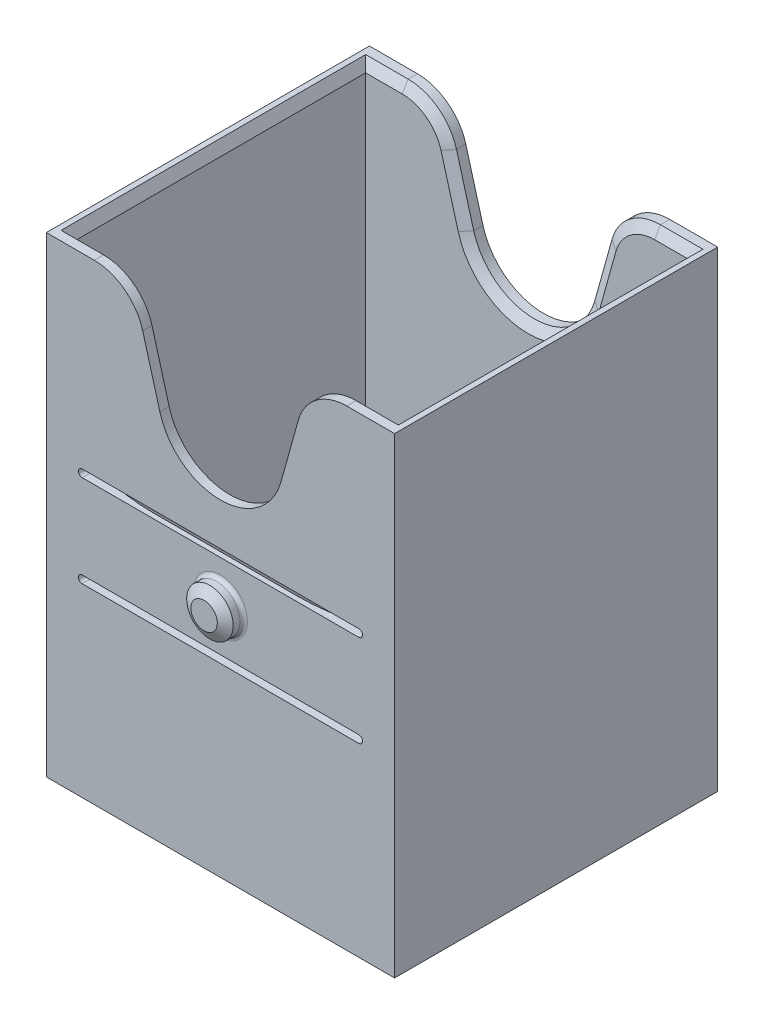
ISO-10303-21;
HEADER;
FILE_DESCRIPTION(('STEP AP214'),'2;1');
FILE_NAME('part.step','',(''),(''),'','','');
FILE_SCHEMA(('AUTOMOTIVE_DESIGN { 1 0 10303 214 1 1 1 1 }'));
ENDSEC;
DATA;
#1=APPLICATION_CONTEXT('core data for automotive mechanical design processes');
#2=APPLICATION_PROTOCOL_DEFINITION('international standard','automotive_design',2000,#1);
#3=PRODUCT_CONTEXT('',#1,'mechanical');
#4=PRODUCT('Part','Part','',(#3));
#5=PRODUCT_RELATED_PRODUCT_CATEGORY('part','',(#4));
#6=PRODUCT_DEFINITION_FORMATION('','',#4);
#7=PRODUCT_DEFINITION_CONTEXT('part definition',#1,'design');
#8=PRODUCT_DEFINITION('design','',#6,#7);
#9=PRODUCT_DEFINITION_SHAPE('','',#8);
#10=(LENGTH_UNIT() NAMED_UNIT(*) SI_UNIT(.MILLI.,.METRE.));
#11=(NAMED_UNIT(*) PLANE_ANGLE_UNIT() SI_UNIT($,.RADIAN.));
#12=(NAMED_UNIT(*) SI_UNIT($,.STERADIAN.) SOLID_ANGLE_UNIT());
#13=UNCERTAINTY_MEASURE_WITH_UNIT(LENGTH_MEASURE(1.E-05),#10,'distance_accuracy_value','');
#14=(GEOMETRIC_REPRESENTATION_CONTEXT(3) GLOBAL_UNCERTAINTY_ASSIGNED_CONTEXT((#13)) GLOBAL_UNIT_ASSIGNED_CONTEXT((#10,
#11,#12)) REPRESENTATION_CONTEXT('',''));
#15=CARTESIAN_POINT('',(0.,0.,0.));
#16=DIRECTION('',(0.,0.,1.));
#17=DIRECTION('',(1.,0.,0.));
#18=AXIS2_PLACEMENT_3D('',#15,#16,#17);
#19=CARTESIAN_POINT('',(-32.893,92.583,29.591));
#20=DIRECTION('',(0.,0.,-1.));
#21=DIRECTION('',(-1.,0.,0.));
#22=AXIS2_PLACEMENT_3D('',#19,#20,#21);
#23=PLANE('',#22);
#24=DIRECTION('',(0.,-1.,0.));
#25=VECTOR('',#24,1.);
#26=CARTESIAN_POINT('',(-32.893,92.583,29.591));
#27=LINE('',#26,#25);
#28=CARTESIAN_POINT('',(-32.893,90.551,29.591));
#29=VERTEX_POINT('',#28);
#30=CARTESIAN_POINT('',(-32.893,0.,29.591));
#31=VERTEX_POINT('',#30);
#32=EDGE_CURVE('E543',#29,#31,#27,.T.);
#33=ORIENTED_EDGE('',*,*,#32,.F.);
#34=DIRECTION('',(1.,0.,0.));
#35=VECTOR('',#34,1.);
#36=CARTESIAN_POINT('',(-32.893,90.551,29.591));
#37=LINE('',#36,#35);
#38=CARTESIAN_POINT('',(-25.4976057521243,90.551,29.591));
#39=VERTEX_POINT('',#38);
#40=EDGE_CURVE('E619',#29,#39,#37,.T.);
#41=ORIENTED_EDGE('',*,*,#40,.T.);
#42=CARTESIAN_POINT('',(-25.4976057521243,82.423,29.591));
#43=DIRECTION('',(0.,0.,-1.));
#44=DIRECTION('',(-1.,0.,0.));
#45=AXIS2_PLACEMENT_3D('',#42,#43,#44);
#46=CIRCLE('',#45,8.12799999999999);
#47=CARTESIAN_POINT('',(-17.6674542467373,84.6031631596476,29.591));
#48=VERTEX_POINT('',#47);
#49=EDGE_CURVE('E617',#39,#48,#46,.T.);
#50=ORIENTED_EDGE('',*,*,#49,.T.);
#51=DIRECTION('',(0.268228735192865,-0.963355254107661,0.));
#52=VECTOR('',#51,1.);
#53=CARTESIAN_POINT('',(-14.192149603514,72.1214542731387,29.591));
#54=LINE('',#53,#52);
#55=CARTESIAN_POINT('',(-14.1921496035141,72.1214542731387,29.591));
#56=VERTEX_POINT('',#55);
#57=EDGE_CURVE('E615',#48,#56,#54,.T.);
#58=ORIENTED_EDGE('',*,*,#57,.T.);
#59=CARTESIAN_POINT('',(0.,76.073,29.591));
#60=DIRECTION('',(0.,0.,-1.));
#61=DIRECTION('',(-1.,0.,0.));
#62=AXIS2_PLACEMENT_3D('',#59,#60,#61);
#63=CIRCLE('',#62,14.732);
#64=CARTESIAN_POINT('',(14.1921496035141,72.1214542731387,29.591));
#65=VERTEX_POINT('',#64);
#66=EDGE_CURVE('E613',#56,#65,#63,.F.);
#67=ORIENTED_EDGE('',*,*,#66,.T.);
#68=DIRECTION('',(0.268228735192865,0.963355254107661,0.));
#69=VECTOR('',#68,1.);
#70=CARTESIAN_POINT('',(17.6674542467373,84.6031631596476,29.591));
#71=LINE('',#70,#69);
#72=CARTESIAN_POINT('',(17.6674542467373,84.6031631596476,29.591));
#73=VERTEX_POINT('',#72);
#74=EDGE_CURVE('E611',#65,#73,#71,.T.);
#75=ORIENTED_EDGE('',*,*,#74,.T.);
#76=CARTESIAN_POINT('',(25.4976057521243,82.423,29.591));
#77=DIRECTION('',(0.,0.,-1.));
#78=DIRECTION('',(-1.,0.,0.));
#79=AXIS2_PLACEMENT_3D('',#76,#77,#78);
#80=CIRCLE('',#79,8.128);
#81=CARTESIAN_POINT('',(25.4976057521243,90.551,29.591));
#82=VERTEX_POINT('',#81);
#83=EDGE_CURVE('E609',#73,#82,#80,.T.);
#84=ORIENTED_EDGE('',*,*,#83,.T.);
#85=DIRECTION('',(1.,0.,0.));
#86=VECTOR('',#85,1.);
#87=CARTESIAN_POINT('',(-32.893,90.551,29.591));
#88=LINE('',#87,#86);
#89=CARTESIAN_POINT('',(32.893,90.551,29.591));
#90=VERTEX_POINT('',#89);
#91=EDGE_CURVE('E607',#82,#90,#88,.T.);
#92=ORIENTED_EDGE('',*,*,#91,.T.);
#93=DIRECTION('',(0.,-1.,0.));
#94=VECTOR('',#93,1.);
#95=CARTESIAN_POINT('',(32.893,92.583,29.591));
#96=LINE('',#95,#94);
#97=CARTESIAN_POINT('',(32.893,0.,29.591));
#98=VERTEX_POINT('',#97);
#99=EDGE_CURVE('E545',#90,#98,#96,.T.);
#100=ORIENTED_EDGE('',*,*,#99,.T.);
#101=DIRECTION('',(1.,0.,0.));
#102=VECTOR('',#101,1.);
#103=CARTESIAN_POINT('',(-32.893,0.,29.591));
#104=LINE('',#103,#102);
#105=EDGE_CURVE('E536',#31,#98,#104,.T.);
#106=ORIENTED_EDGE('',*,*,#105,.F.);
#107=EDGE_LOOP('',(#33,#41,#50,#58,#67,#75,#84,#92,#100,#106));
#108=FACE_BOUND('',#107,.T.);
#109=DIRECTION('',(1.,0.,0.));
#110=VECTOR('',#109,1.);
#111=CARTESIAN_POINT('',(-32.893,32.737957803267,29.591));
#112=LINE('',#111,#110);
#113=CARTESIAN_POINT('',(-27.94,32.737957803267,29.591));
#114=VERTEX_POINT('',#113);
#115=CARTESIAN_POINT('',(27.94,32.737957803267,29.591));
#116=VERTEX_POINT('',#115);
#117=EDGE_CURVE('E663',#114,#116,#112,.T.);
#118=ORIENTED_EDGE('',*,*,#117,.T.);
#119=CARTESIAN_POINT('',(27.94,35.531957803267,29.591));
#120=DIRECTION('',(0.,0.,-1.));
#121=DIRECTION('',(-1.,0.,0.));
#122=AXIS2_PLACEMENT_3D('',#119,#120,#121);
#123=CIRCLE('',#122,2.794);
#124=CARTESIAN_POINT('',(27.94,38.325957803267,29.591));
#125=VERTEX_POINT('',#124);
#126=EDGE_CURVE('E667',#116,#125,#123,.F.);
#127=ORIENTED_EDGE('',*,*,#126,.T.);
#128=DIRECTION('',(0.,1.,0.));
#129=VECTOR('',#128,1.);
#130=CARTESIAN_POINT('',(27.94,-2.287,29.591));
#131=LINE('',#130,#129);
#132=CARTESIAN_POINT('',(27.94,53.3213573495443,29.591));
#133=VERTEX_POINT('',#132);
#134=EDGE_CURVE('E469',#125,#133,#131,.T.);
#135=ORIENTED_EDGE('',*,*,#134,.T.);
#136=CARTESIAN_POINT('',(27.94,54.0833573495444,29.591));
#137=DIRECTION('',(0.,0.,-1.));
#138=DIRECTION('',(-1.,0.,0.));
#139=AXIS2_PLACEMENT_3D('',#136,#137,#138);
#140=CIRCLE('',#139,0.762000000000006);
#141=CARTESIAN_POINT('',(27.94,54.8453573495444,29.591));
#142=VERTEX_POINT('',#141);
#143=EDGE_CURVE('E500',#133,#142,#140,.F.);
#144=ORIENTED_EDGE('',*,*,#143,.T.);
#145=DIRECTION('',(-1.,0.,0.));
#146=VECTOR('',#145,1.);
#147=CARTESIAN_POINT('',(27.94,54.8453573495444,29.591));
#148=LINE('',#147,#146);
#149=CARTESIAN_POINT('',(-27.94,54.8453573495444,29.591));
#150=VERTEX_POINT('',#149);
#151=EDGE_CURVE('E517',#142,#150,#148,.T.);
#152=ORIENTED_EDGE('',*,*,#151,.T.);
#153=CARTESIAN_POINT('',(-27.94,54.0833573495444,29.591));
#154=DIRECTION('',(0.,0.,-1.));
#155=DIRECTION('',(-1.,0.,0.));
#156=AXIS2_PLACEMENT_3D('',#153,#154,#155);
#157=CIRCLE('',#156,0.762000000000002);
#158=CARTESIAN_POINT('',(-27.94,53.3213573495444,29.591));
#159=VERTEX_POINT('',#158);
#160=EDGE_CURVE('E492',#150,#159,#157,.F.);
#161=ORIENTED_EDGE('',*,*,#160,.T.);
#162=DIRECTION('',(0.,1.,0.));
#163=VECTOR('',#162,1.);
#164=CARTESIAN_POINT('',(-27.94,-2.287,29.591));
#165=LINE('',#164,#163);
#166=CARTESIAN_POINT('',(-27.94,38.325957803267,29.591));
#167=VERTEX_POINT('',#166);
#168=EDGE_CURVE('E475',#167,#159,#165,.T.);
#169=ORIENTED_EDGE('',*,*,#168,.F.);
#170=CARTESIAN_POINT('',(-27.94,35.531957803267,29.591));
#171=DIRECTION('',(0.,0.,-1.));
#172=DIRECTION('',(-1.,0.,0.));
#173=AXIS2_PLACEMENT_3D('',#170,#171,#172);
#174=CIRCLE('',#173,2.794);
#175=EDGE_CURVE('E665',#167,#114,#174,.F.);
#176=ORIENTED_EDGE('',*,*,#175,.T.);
#177=EDGE_LOOP('',(#118,#127,#135,#144,#152,#161,#169,#176));
#178=FACE_BOUND('',#177,.T.);
#179=ADVANCED_FACE('F37',(#108,#178),#23,.T.);
#180=CARTESIAN_POINT('',(-27.94,53.3213573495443,-0.00100000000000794));
#181=DIRECTION('',(0.,-1.,0.));
#182=DIRECTION('',(0.,0.,-1.));
#183=AXIS2_PLACEMENT_3D('',#180,#181,#182);
#184=PLANE('',#183);
#185=DIRECTION('',(0.974858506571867,0.,0.222824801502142));
#186=VECTOR('',#185,1.);
#187=CARTESIAN_POINT('',(-19.05,53.3213573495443,31.623));
#188=LINE('',#187,#186);
#189=CARTESIAN_POINT('',(-23.2407726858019,53.3213573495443,30.6651091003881));
#190=VERTEX_POINT('',#189);
#191=EDGE_CURVE('E459',#159,#190,#188,.T.);
#192=ORIENTED_EDGE('',*,*,#191,.F.);
#193=DIRECTION('',(0.,0.,1.));
#194=VECTOR('',#193,1.);
#195=CARTESIAN_POINT('',(-27.94,53.3213573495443,-0.00100000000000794));
#196=LINE('',#195,#194);
#197=CARTESIAN_POINT('',(-27.94,53.3213573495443,32.639));
#198=VERTEX_POINT('',#197);
#199=EDGE_CURVE('E518',#159,#198,#196,.T.);
#200=ORIENTED_EDGE('',*,*,#199,.T.);
#201=DIRECTION('',(1.,0.,0.));
#202=VECTOR('',#201,1.);
#203=CARTESIAN_POINT('',(-27.94,53.3213573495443,32.639));
#204=LINE('',#203,#202);
#205=CARTESIAN_POINT('',(27.94,53.3213573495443,32.639));
#206=VERTEX_POINT('',#205);
#207=EDGE_CURVE('E511',#198,#206,#204,.T.);
#208=ORIENTED_EDGE('',*,*,#207,.T.);
#209=DIRECTION('',(0.,0.,1.));
#210=VECTOR('',#209,1.);
#211=CARTESIAN_POINT('',(27.94,53.3213573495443,-0.00100000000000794));
#212=LINE('',#211,#210);
#213=EDGE_CURVE('E515',#133,#206,#212,.T.);
#214=ORIENTED_EDGE('',*,*,#213,.F.);
#215=DIRECTION('',(0.974858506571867,0.,-0.222824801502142));
#216=VECTOR('',#215,1.);
#217=CARTESIAN_POINT('',(27.94,53.3213573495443,29.591));
#218=LINE('',#217,#216);
#219=CARTESIAN_POINT('',(23.2407726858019,53.3213573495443,30.6651091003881));
#220=VERTEX_POINT('',#219);
#221=EDGE_CURVE('E463',#220,#133,#218,.T.);
#222=ORIENTED_EDGE('',*,*,#221,.F.);
#223=CARTESIAN_POINT('',(14.7511477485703,53.3213573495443,-6.477));
#224=DIRECTION('',(0.,-1.,0.));
#225=DIRECTION('',(0.,0.,-1.));
#226=AXIS2_PLACEMENT_3D('',#223,#224,#225);
#227=CIRCLE('',#226,38.1);
#228=CARTESIAN_POINT('',(14.7511477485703,53.3213573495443,31.623));
#229=VERTEX_POINT('',#228);
#230=EDGE_CURVE('E590',#220,#229,#227,.T.);
#231=ORIENTED_EDGE('',*,*,#230,.T.);
#232=DIRECTION('',(1.,0.,0.));
#233=VECTOR('',#232,1.);
#234=CARTESIAN_POINT('',(19.05,53.3213573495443,31.623));
#235=LINE('',#234,#233);
#236=CARTESIAN_POINT('',(-14.7511477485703,53.3213573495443,31.623));
#237=VERTEX_POINT('',#236);
#238=EDGE_CURVE('E456',#237,#229,#235,.T.);
#239=ORIENTED_EDGE('',*,*,#238,.F.);
#240=CARTESIAN_POINT('',(-14.7511477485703,53.3213573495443,-6.477));
#241=DIRECTION('',(0.,-1.,0.));
#242=DIRECTION('',(0.,0.,-1.));
#243=AXIS2_PLACEMENT_3D('',#240,#241,#242);
#244=CIRCLE('',#243,38.1);
#245=EDGE_CURVE('E586',#237,#190,#244,.T.);
#246=ORIENTED_EDGE('',*,*,#245,.T.);
#247=EDGE_LOOP('',(#192,#200,#208,#214,#222,#231,#239,#246));
#248=FACE_BOUND('',#247,.T.);
#249=ADVANCED_FACE('F689',(#248),#184,.F.);
#250=CARTESIAN_POINT('',(-27.94,36.293957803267,-0.00100000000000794));
#251=DIRECTION('',(0.,-1.,0.));
#252=DIRECTION('',(0.,0.,-1.));
#253=AXIS2_PLACEMENT_3D('',#250,#251,#252);
#254=PLANE('',#253);
#255=DIRECTION('',(-0.974858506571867,0.,0.222824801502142));
#256=VECTOR('',#255,1.);
#257=CARTESIAN_POINT('',(27.94,36.293957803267,29.591));
#258=LINE('',#257,#256);
#259=CARTESIAN_POINT('',(26.0440117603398,36.293957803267,30.0243687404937));
#260=VERTEX_POINT('',#259);
#261=CARTESIAN_POINT('',(23.2407726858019,36.293957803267,30.6651091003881));
#262=VERTEX_POINT('',#261);
#263=EDGE_CURVE('E466',#260,#262,#258,.T.);
#264=ORIENTED_EDGE('',*,*,#263,.F.);
#265=CARTESIAN_POINT('',(26.0440117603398,36.293957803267,30.0243687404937));
#266=CARTESIAN_POINT('',(26.0966215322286,36.293957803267,30.0525466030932));
#267=CARTESIAN_POINT('',(26.1492954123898,36.293957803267,30.0806060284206));
#268=CARTESIAN_POINT('',(26.2548176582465,36.293957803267,30.136404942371));
#269=CARTESIAN_POINT('',(26.3076660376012,36.293957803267,30.164144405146));
#270=CARTESIAN_POINT('',(26.4137074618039,36.293957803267,30.219284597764));
#271=CARTESIAN_POINT('',(26.4669010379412,36.293957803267,30.2466843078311));
#272=CARTESIAN_POINT('',(26.5735607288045,36.293957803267,30.3009439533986));
#273=CARTESIAN_POINT('',(26.6270268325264,36.293957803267,30.3278039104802));
#274=CARTESIAN_POINT('',(26.7331159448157,36.293957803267,30.3802082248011));
#275=CARTESIAN_POINT('',(26.7857310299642,36.293957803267,30.4057685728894));
#276=CARTESIAN_POINT('',(26.8914088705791,36.293957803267,30.4559451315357));
#277=CARTESIAN_POINT('',(26.9444716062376,36.293957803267,30.4805613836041));
#278=CARTESIAN_POINT('',(27.0511743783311,36.293957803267,30.5284618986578));
#279=CARTESIAN_POINT('',(27.1048141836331,36.293957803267,30.5517466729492));
#280=CARTESIAN_POINT('',(27.212876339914,36.293957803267,30.5964090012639));
#281=CARTESIAN_POINT('',(27.26729848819,36.293957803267,30.6177870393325));
#282=CARTESIAN_POINT('',(27.3716269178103,36.293957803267,30.6557182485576));
#283=CARTESIAN_POINT('',(27.4214337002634,36.293957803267,30.6725406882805));
#284=CARTESIAN_POINT('',(27.5219577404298,36.293957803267,30.7029274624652));
#285=CARTESIAN_POINT('',(27.5726732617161,36.293957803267,30.7164974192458));
#286=CARTESIAN_POINT('',(27.6756331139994,36.293957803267,30.7392631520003));
#287=CARTESIAN_POINT('',(27.7278873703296,36.293957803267,30.7484163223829));
#288=CARTESIAN_POINT('',(27.8069375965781,36.293957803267,30.7577693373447));
#289=CARTESIAN_POINT('',(27.8334797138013,36.293957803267,30.76015807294));
#290=CARTESIAN_POINT('',(27.8866785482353,36.293957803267,30.7633671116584));
#291=CARTESIAN_POINT('',(27.9133353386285,36.293957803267,30.764186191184));
#292=CARTESIAN_POINT('',(27.94,36.293957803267,30.7641757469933));
#293=B_SPLINE_CURVE_WITH_KNOTS('',3,(#265,#266,#267,#268,#269,#270,#271,#272,#273,#274,#275,
#276,#277,#278,#279,#280,#281,#282,#283,#284,#285,#286,#287,#288,#289,#290,#291,#292),
.UNSPECIFIED.,.F.,.F.,(4,2,2,2,2,2,2,2,2,2,2,2,2,4),(0.,0.179042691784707,0.358099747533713,
0.537604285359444,0.717101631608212,0.89258036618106,1.06805137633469,1.24345454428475,
1.41881305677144,1.57644842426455,1.73380930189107,1.89265920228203,1.97256460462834,
2.05253227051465),.UNSPECIFIED.);
#294=CARTESIAN_POINT('',(27.94,36.293957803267,30.7641757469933));
#295=VERTEX_POINT('',#294);
#296=EDGE_CURVE('E677',#260,#295,#293,.T.);
#297=ORIENTED_EDGE('',*,*,#296,.T.);
#298=DIRECTION('',(0.,0.,1.));
#299=VECTOR('',#298,1.);
#300=CARTESIAN_POINT('',(27.94,36.293957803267,-0.00100000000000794));
#301=LINE('',#300,#299);
#302=CARTESIAN_POINT('',(27.94,36.293957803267,32.639));
#303=VERTEX_POINT('',#302);
#304=EDGE_CURVE('E489',#295,#303,#301,.T.);
#305=ORIENTED_EDGE('',*,*,#304,.T.);
#306=DIRECTION('',(1.,0.,0.));
#307=VECTOR('',#306,1.);
#308=CARTESIAN_POINT('',(-27.94,36.293957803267,32.639));
#309=LINE('',#308,#307);
#310=CARTESIAN_POINT('',(-27.94,36.293957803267,32.639));
#311=VERTEX_POINT('',#310);
#312=EDGE_CURVE('E480',#311,#303,#309,.T.);
#313=ORIENTED_EDGE('',*,*,#312,.F.);
#314=DIRECTION('',(0.,0.,1.));
#315=VECTOR('',#314,1.);
#316=CARTESIAN_POINT('',(-27.94,36.293957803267,-0.00100000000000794));
#317=LINE('',#316,#315);
#318=CARTESIAN_POINT('',(-27.94,36.293957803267,30.7641757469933));
#319=VERTEX_POINT('',#318);
#320=EDGE_CURVE('E495',#319,#311,#317,.T.);
#321=ORIENTED_EDGE('',*,*,#320,.F.);
#322=CARTESIAN_POINT('',(-27.94,36.293957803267,30.7641757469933));
#323=CARTESIAN_POINT('',(-27.9180058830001,36.293957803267,30.7641804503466));
#324=CARTESIAN_POINT('',(-27.8960158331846,36.293957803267,30.7636255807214));
#325=CARTESIAN_POINT('',(-27.8520979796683,36.293957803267,30.7614373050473));
#326=CARTESIAN_POINT('',(-27.8301701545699,36.293957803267,30.7598043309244));
#327=CARTESIAN_POINT('',(-27.7647163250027,36.293957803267,30.7533662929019));
#328=CARTESIAN_POINT('',(-27.7213366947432,36.293957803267,30.7470214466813));
#329=CARTESIAN_POINT('',(-27.63562574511,36.293957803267,30.7309530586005));
#330=CARTESIAN_POINT('',(-27.5932885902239,36.293957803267,30.7212593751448));
#331=CARTESIAN_POINT('',(-27.5092767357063,36.293957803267,30.699218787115));
#332=CARTESIAN_POINT('',(-27.4676027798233,36.293957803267,30.6868691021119));
#333=CARTESIAN_POINT('',(-27.3665302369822,36.293957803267,30.6542536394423));
#334=CARTESIAN_POINT('',(-27.3074843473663,36.293957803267,30.632908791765));
#335=CARTESIAN_POINT('',(-27.1904341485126,36.293957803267,30.5875078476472));
#336=CARTESIAN_POINT('',(-27.1324304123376,36.293957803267,30.5634503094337));
#337=CARTESIAN_POINT('',(-27.0171041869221,36.293957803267,30.5134820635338));
#338=CARTESIAN_POINT('',(-26.9597831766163,36.293957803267,30.4875679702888));
#339=CARTESIAN_POINT('',(-26.8457196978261,36.293957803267,30.4344941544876));
#340=CARTESIAN_POINT('',(-26.7889772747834,36.293957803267,30.4073343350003));
#341=CARTESIAN_POINT('',(-26.6742709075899,36.293957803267,30.3513268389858));
#342=CARTESIAN_POINT('',(-26.6163197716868,36.293957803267,30.3224530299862));
#343=CARTESIAN_POINT('',(-26.5007549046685,36.293957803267,30.2640290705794));
#344=CARTESIAN_POINT('',(-26.4431411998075,36.293957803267,30.2344788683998));
#345=CARTESIAN_POINT('',(-26.3284923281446,36.293957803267,30.1750450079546));
#346=CARTESIAN_POINT('',(-26.2714557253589,36.293957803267,30.1451641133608));
#347=CARTESIAN_POINT('',(-26.1575921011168,36.293957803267,30.0850236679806));
#348=CARTESIAN_POINT('',(-26.1007650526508,36.293957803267,30.0547641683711));
#349=CARTESIAN_POINT('',(-26.0440117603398,36.293957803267,30.0243687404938));
#350=B_SPLINE_CURVE_WITH_KNOTS('',3,(#322,#323,#324,#325,#326,#327,#328,#329,#330,#331,#332,
#333,#334,#335,#336,#337,#338,#339,#340,#341,#342,#343,#344,#345,#346,#347,#348,#349),
.UNSPECIFIED.,.F.,.F.,(4,2,2,2,2,2,2,2,2,2,2,2,2,4),(0.,0.0659679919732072,0.131909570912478,
0.263245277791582,0.393438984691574,0.523769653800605,0.712014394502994,0.900359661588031,
1.08905758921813,1.27777022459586,1.47200189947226,1.66624849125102,1.85941620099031,
2.05255807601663),.UNSPECIFIED.);
#351=CARTESIAN_POINT('',(-26.0440117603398,36.293957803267,30.0243687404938));
#352=VERTEX_POINT('',#351);
#353=EDGE_CURVE('E62',#319,#352,#350,.T.);
#354=ORIENTED_EDGE('',*,*,#353,.T.);
#355=DIRECTION('',(-0.974858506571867,0.,-0.222824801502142));
#356=VECTOR('',#355,1.);
#357=CARTESIAN_POINT('',(-19.05,36.293957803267,31.623));
#358=LINE('',#357,#356);
#359=CARTESIAN_POINT('',(-23.2407726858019,36.293957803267,30.6651091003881));
#360=VERTEX_POINT('',#359);
#361=EDGE_CURVE('E467',#360,#352,#358,.T.);
#362=ORIENTED_EDGE('',*,*,#361,.F.);
#363=CARTESIAN_POINT('',(-14.7511477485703,36.293957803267,-6.477));
#364=DIRECTION('',(0.,-1.,0.));
#365=DIRECTION('',(0.,0.,-1.));
#366=AXIS2_PLACEMENT_3D('',#363,#364,#365);
#367=CIRCLE('',#366,38.1);
#368=CARTESIAN_POINT('',(-14.7511477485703,36.293957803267,31.623));
#369=VERTEX_POINT('',#368);
#370=EDGE_CURVE('E588',#360,#369,#367,.F.);
#371=ORIENTED_EDGE('',*,*,#370,.T.);
#372=DIRECTION('',(-1.,0.,0.));
#373=VECTOR('',#372,1.);
#374=CARTESIAN_POINT('',(19.05,36.293957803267,31.623));
#375=LINE('',#374,#373);
#376=CARTESIAN_POINT('',(14.7511477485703,36.293957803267,31.623));
#377=VERTEX_POINT('',#376);
#378=EDGE_CURVE('E470',#377,#369,#375,.T.);
#379=ORIENTED_EDGE('',*,*,#378,.F.);
#380=CARTESIAN_POINT('',(14.7511477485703,36.293957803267,-6.477));
#381=DIRECTION('',(0.,-1.,0.));
#382=DIRECTION('',(0.,0.,-1.));
#383=AXIS2_PLACEMENT_3D('',#380,#381,#382);
#384=CIRCLE('',#383,38.1);
#385=EDGE_CURVE('E592',#377,#262,#384,.F.);
#386=ORIENTED_EDGE('',*,*,#385,.T.);
#387=EDGE_LOOP('',(#264,#297,#305,#313,#321,#354,#362,#371,#379,#386));
#388=FACE_BOUND('',#387,.T.);
#389=ADVANCED_FACE('F684',(#388),#254,.T.);
#390=CARTESIAN_POINT('',(-32.893,92.583,32.639));
#391=DIRECTION('',(0.,0.,-1.));
#392=DIRECTION('',(-1.,0.,0.));
#393=AXIS2_PLACEMENT_3D('',#390,#391,#392);
#394=PLANE('',#393);
#395=CARTESIAN_POINT('',(0.,44.8076575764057,32.639));
#396=DIRECTION('',(0.,0.,-1.));
#397=DIRECTION('',(-1.,0.,0.));
#398=AXIS2_PLACEMENT_3D('',#395,#396,#397);
#399=CIRCLE('',#398,5.461);
#400=CARTESIAN_POINT('',(-5.46099999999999,44.8076575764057,32.639));
#401=VERTEX_POINT('',#400);
#402=EDGE_CURVE('E598',#401,#401,#399,.T.);
#403=ORIENTED_EDGE('',*,*,#402,.T.);
#404=EDGE_LOOP('',(#403));
#405=FACE_BOUND('',#404,.T.);
#406=DIRECTION('',(-0.268228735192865,0.963355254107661,0.));
#407=VECTOR('',#406,1.);
#408=CARTESIAN_POINT('',(-18.8673297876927,96.4881925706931,32.639));
#409=LINE('',#408,#407);
#410=CARTESIAN_POINT('',(-12.2346117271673,72.6664950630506,32.639));
#411=VERTEX_POINT('',#410);
#412=CARTESIAN_POINT('',(-15.7099163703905,85.1482039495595,32.639));
#413=VERTEX_POINT('',#412);
#414=EDGE_CURVE('E530',#411,#413,#409,.T.);
#415=ORIENTED_EDGE('',*,*,#414,.T.);
#416=CARTESIAN_POINT('',(-25.4976057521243,82.423,32.639));
#417=DIRECTION('',(0.,0.,-1.));
#418=DIRECTION('',(-1.,0.,0.));
#419=AXIS2_PLACEMENT_3D('',#416,#417,#418);
#420=CIRCLE('',#419,10.16);
#421=CARTESIAN_POINT('',(-25.4976057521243,92.583,32.639));
#422=VERTEX_POINT('',#421);
#423=EDGE_CURVE('E560',#413,#422,#420,.F.);
#424=ORIENTED_EDGE('',*,*,#423,.T.);
#425=DIRECTION('',(1.,0.,0.));
#426=VECTOR('',#425,1.);
#427=CARTESIAN_POINT('',(-32.893,92.583,32.639));
#428=LINE('',#427,#426);
#429=CARTESIAN_POINT('',(-35.179,92.583,32.639));
#430=VERTEX_POINT('',#429);
#431=EDGE_CURVE('E550',#430,#422,#428,.T.);
#432=ORIENTED_EDGE('',*,*,#431,.F.);
#433=DIRECTION('',(0.,-1.,0.));
#434=VECTOR('',#433,1.);
#435=CARTESIAN_POINT('',(-35.179,92.583,32.639));
#436=LINE('',#435,#434);
#437=CARTESIAN_POINT('',(-35.179,-2.667,32.639));
#438=VERTEX_POINT('',#437);
#439=EDGE_CURVE('E328',#430,#438,#436,.T.);
#440=ORIENTED_EDGE('',*,*,#439,.T.);
#441=DIRECTION('',(-1.,0.,0.));
#442=VECTOR('',#441,1.);
#443=CARTESIAN_POINT('',(35.179,-2.667,32.639));
#444=LINE('',#443,#442);
#445=CARTESIAN_POINT('',(35.179,-2.667,32.639));
#446=VERTEX_POINT('',#445);
#447=EDGE_CURVE('E331',#446,#438,#444,.T.);
#448=ORIENTED_EDGE('',*,*,#447,.F.);
#449=DIRECTION('',(0.,-1.,0.));
#450=VECTOR('',#449,1.);
#451=CARTESIAN_POINT('',(35.179,92.583,32.639));
#452=LINE('',#451,#450);
#453=CARTESIAN_POINT('',(35.179,92.583,32.639));
#454=VERTEX_POINT('',#453);
#455=EDGE_CURVE('E318',#454,#446,#452,.T.);
#456=ORIENTED_EDGE('',*,*,#455,.F.);
#457=CARTESIAN_POINT('',(25.4976057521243,92.583,32.639));
#458=VERTEX_POINT('',#457);
#459=EDGE_CURVE('E546',#458,#454,#428,.T.);
#460=ORIENTED_EDGE('',*,*,#459,.F.);
#461=CARTESIAN_POINT('',(25.4976057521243,82.423,32.639));
#462=DIRECTION('',(0.,0.,-1.));
#463=DIRECTION('',(-1.,0.,0.));
#464=AXIS2_PLACEMENT_3D('',#461,#462,#463);
#465=CIRCLE('',#464,10.16);
#466=CARTESIAN_POINT('',(15.7099163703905,85.1482039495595,32.639));
#467=VERTEX_POINT('',#466);
#468=EDGE_CURVE('E558',#458,#467,#465,.F.);
#469=ORIENTED_EDGE('',*,*,#468,.T.);
#470=DIRECTION('',(-0.268228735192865,-0.963355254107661,0.));
#471=VECTOR('',#470,1.);
#472=CARTESIAN_POINT('',(14.1342471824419,79.489119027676,32.639));
#473=LINE('',#472,#471);
#474=CARTESIAN_POINT('',(12.2346117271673,72.6664950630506,32.639));
#475=VERTEX_POINT('',#474);
#476=EDGE_CURVE('E533',#467,#475,#473,.T.);
#477=ORIENTED_EDGE('',*,*,#476,.T.);
#478=CARTESIAN_POINT('',(0.,76.073,32.639));
#479=DIRECTION('',(0.,0.,1.));
#480=DIRECTION('',(1.,0.,0.));
#481=AXIS2_PLACEMENT_3D('',#478,#479,#480);
#482=CIRCLE('',#481,12.7);
#483=EDGE_CURVE('E532',#411,#475,#482,.T.);
#484=ORIENTED_EDGE('',*,*,#483,.F.);
#485=EDGE_LOOP('',(#415,#424,#432,#440,#448,#456,#460,#469,#477,#484));
#486=FACE_BOUND('',#485,.T.);
#487=DIRECTION('',(-1.,0.,0.));
#488=VECTOR('',#487,1.);
#489=CARTESIAN_POINT('',(27.94,54.8453573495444,32.639));
#490=LINE('',#489,#488);
#491=CARTESIAN_POINT('',(27.94,54.8453573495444,32.639));
#492=VERTEX_POINT('',#491);
#493=CARTESIAN_POINT('',(-27.94,54.8453573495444,32.639));
#494=VERTEX_POINT('',#493);
#495=EDGE_CURVE('E505',#492,#494,#490,.T.);
#496=ORIENTED_EDGE('',*,*,#495,.F.);
#497=CARTESIAN_POINT('',(27.94,54.0833573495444,32.639));
#498=DIRECTION('',(0.,0.,1.));
#499=DIRECTION('',(1.,0.,0.));
#500=AXIS2_PLACEMENT_3D('',#497,#498,#499);
#501=CIRCLE('',#500,0.762000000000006);
#502=EDGE_CURVE('E503',#206,#492,#501,.T.);
#503=ORIENTED_EDGE('',*,*,#502,.F.);
#504=ORIENTED_EDGE('',*,*,#207,.F.);
#505=CARTESIAN_POINT('',(-27.94,54.0833573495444,32.639));
#506=DIRECTION('',(0.,0.,1.));
#507=DIRECTION('',(-1.,0.,0.));
#508=AXIS2_PLACEMENT_3D('',#505,#506,#507);
#509=CIRCLE('',#508,0.762000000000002);
#510=EDGE_CURVE('E508',#494,#198,#509,.T.);
#511=ORIENTED_EDGE('',*,*,#510,.F.);
#512=EDGE_LOOP('',(#496,#503,#504,#511));
#513=FACE_BOUND('',#512,.T.);
#514=CARTESIAN_POINT('',(27.94,35.531957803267,32.639));
#515=DIRECTION('',(0.,0.,-1.));
#516=DIRECTION('',(1.,0.,0.));
#517=AXIS2_PLACEMENT_3D('',#514,#515,#516);
#518=CIRCLE('',#517,0.762000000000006);
#519=CARTESIAN_POINT('',(27.94,34.769957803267,32.639));
#520=VERTEX_POINT('',#519);
#521=EDGE_CURVE('E477',#303,#520,#518,.T.);
#522=ORIENTED_EDGE('',*,*,#521,.T.);
#523=DIRECTION('',(-1.,0.,0.));
#524=VECTOR('',#523,1.);
#525=CARTESIAN_POINT('',(27.94,34.769957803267,32.639));
#526=LINE('',#525,#524);
#527=CARTESIAN_POINT('',(-27.94,34.769957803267,32.639));
#528=VERTEX_POINT('',#527);
#529=EDGE_CURVE('E486',#520,#528,#526,.T.);
#530=ORIENTED_EDGE('',*,*,#529,.T.);
#531=CARTESIAN_POINT('',(-27.94,35.531957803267,32.639));
#532=DIRECTION('',(0.,0.,-1.));
#533=DIRECTION('',(-1.,0.,0.));
#534=AXIS2_PLACEMENT_3D('',#531,#532,#533);
#535=CIRCLE('',#534,0.762000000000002);
#536=EDGE_CURVE('E483',#528,#311,#535,.T.);
#537=ORIENTED_EDGE('',*,*,#536,.T.);
#538=ORIENTED_EDGE('',*,*,#312,.T.);
#539=EDGE_LOOP('',(#522,#530,#537,#538));
#540=FACE_BOUND('',#539,.T.);
#541=ADVANCED_FACE('F333',(#405,#486,#513,#540),#394,.F.);
#542=CARTESIAN_POINT('',(0.,92.583,0.));
#543=DIRECTION('',(0.,1.,0.));
#544=DIRECTION('',(0.,0.,1.));
#545=AXIS2_PLACEMENT_3D('',#542,#543,#544);
#546=PLANE('',#545);
#547=DIRECTION('',(0.,0.,1.));
#548=VECTOR('',#547,1.);
#549=CARTESIAN_POINT('',(34.0661757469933,92.583,0.));
#550=LINE('',#549,#548);
#551=CARTESIAN_POINT('',(34.0661757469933,92.583,-30.7641757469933));
#552=VERTEX_POINT('',#551);
#553=CARTESIAN_POINT('',(34.0661757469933,92.583,30.7641757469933));
#554=VERTEX_POINT('',#553);
#555=EDGE_CURVE('E631',#552,#554,#550,.T.);
#556=ORIENTED_EDGE('',*,*,#555,.T.);
#557=DIRECTION('',(-1.,0.,0.));
#558=VECTOR('',#557,1.);
#559=CARTESIAN_POINT('',(0.,92.583,30.7641757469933));
#560=LINE('',#559,#558);
#561=CARTESIAN_POINT('',(25.4976057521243,92.583,30.7641757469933));
#562=VERTEX_POINT('',#561);
#563=EDGE_CURVE('E633',#554,#562,#560,.T.);
#564=ORIENTED_EDGE('',*,*,#563,.T.);
#565=DIRECTION('',(0.,0.,1.));
#566=VECTOR('',#565,1.);
#567=CARTESIAN_POINT('',(25.4976057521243,92.583,32.639));
#568=LINE('',#567,#566);
#569=EDGE_CURVE('E565',#562,#458,#568,.T.);
#570=ORIENTED_EDGE('',*,*,#569,.T.);
#571=ORIENTED_EDGE('',*,*,#459,.T.);
#572=DIRECTION('',(0.,0.,-1.));
#573=VECTOR('',#572,1.);
#574=CARTESIAN_POINT('',(35.179,92.583,29.591));
#575=LINE('',#574,#573);
#576=CARTESIAN_POINT('',(35.179,92.583,-32.639));
#577=VERTEX_POINT('',#576);
#578=EDGE_CURVE('E324',#454,#577,#575,.T.);
#579=ORIENTED_EDGE('',*,*,#578,.T.);
#580=DIRECTION('',(1.,0.,0.));
#581=VECTOR('',#580,1.);
#582=CARTESIAN_POINT('',(-32.893,92.583,-32.639));
#583=LINE('',#582,#581);
#584=CARTESIAN_POINT('',(25.4976057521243,92.583,-32.639));
#585=VERTEX_POINT('',#584);
#586=EDGE_CURVE('E358',#585,#577,#583,.T.);
#587=ORIENTED_EDGE('',*,*,#586,.F.);
#588=DIRECTION('',(0.,0.,-1.));
#589=VECTOR('',#588,1.);
#590=CARTESIAN_POINT('',(25.4976057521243,92.583,-32.639));
#591=LINE('',#590,#589);
#592=CARTESIAN_POINT('',(25.4976057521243,92.583,-30.7641757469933));
#593=VERTEX_POINT('',#592);
#594=EDGE_CURVE('E398',#593,#585,#591,.T.);
#595=ORIENTED_EDGE('',*,*,#594,.F.);
#596=DIRECTION('',(-1.,0.,0.));
#597=VECTOR('',#596,1.);
#598=CARTESIAN_POINT('',(0.,92.583,-30.7641757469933));
#599=LINE('',#598,#597);
#600=EDGE_CURVE('E452',#552,#593,#599,.T.);
#601=ORIENTED_EDGE('',*,*,#600,.F.);
#602=EDGE_LOOP('',(#556,#564,#570,#571,#579,#587,#595,#601));
#603=FACE_BOUND('',#602,.T.);
#604=ADVANCED_FACE('F756',(#603),#546,.T.);
#605=CARTESIAN_POINT('',(35.179,92.583,29.591));
#606=DIRECTION('',(-1.,0.,0.));
#607=DIRECTION('',(0.,0.,1.));
#608=AXIS2_PLACEMENT_3D('',#605,#606,#607);
#609=PLANE('',#608);
#610=ORIENTED_EDGE('',*,*,#455,.T.);
#611=DIRECTION('',(0.,0.,1.));
#612=VECTOR('',#611,1.);
#613=CARTESIAN_POINT('',(35.179,-2.667,-32.639));
#614=LINE('',#613,#612);
#615=CARTESIAN_POINT('',(35.179,-2.667,-32.639));
#616=VERTEX_POINT('',#615);
#617=EDGE_CURVE('E323',#616,#446,#614,.T.);
#618=ORIENTED_EDGE('',*,*,#617,.F.);
#619=DIRECTION('',(0.,-1.,0.));
#620=VECTOR('',#619,1.);
#621=CARTESIAN_POINT('',(35.179,92.583,-32.639));
#622=LINE('',#621,#620);
#623=EDGE_CURVE('E360',#577,#616,#622,.T.);
#624=ORIENTED_EDGE('',*,*,#623,.F.);
#625=ORIENTED_EDGE('',*,*,#578,.F.);
#626=EDGE_LOOP('',(#610,#618,#624,#625));
#627=FACE_BOUND('',#626,.T.);
#628=ADVANCED_FACE('F320',(#627),#609,.F.);
#629=CARTESIAN_POINT('',(-35.179,92.583,29.591));
#630=DIRECTION('',(-1.,0.,0.));
#631=DIRECTION('',(0.,0.,1.));
#632=AXIS2_PLACEMENT_3D('',#629,#630,#631);
#633=PLANE('',#632);
#634=DIRECTION('',(0.,-1.,0.));
#635=VECTOR('',#634,1.);
#636=CARTESIAN_POINT('',(-35.179,92.583,-32.639));
#637=LINE('',#636,#635);
#638=CARTESIAN_POINT('',(-35.179,92.583,-32.639));
#639=VERTEX_POINT('',#638);
#640=CARTESIAN_POINT('',(-35.179,-2.667,-32.639));
#641=VERTEX_POINT('',#640);
#642=EDGE_CURVE('E357',#639,#641,#637,.T.);
#643=ORIENTED_EDGE('',*,*,#642,.T.);
#644=DIRECTION('',(0.,0.,-1.));
#645=VECTOR('',#644,1.);
#646=CARTESIAN_POINT('',(-35.179,-2.667,32.639));
#647=LINE('',#646,#645);
#648=EDGE_CURVE('E339',#438,#641,#647,.T.);
#649=ORIENTED_EDGE('',*,*,#648,.F.);
#650=ORIENTED_EDGE('',*,*,#439,.F.);
#651=DIRECTION('',(0.,0.,-1.));
#652=VECTOR('',#651,1.);
#653=CARTESIAN_POINT('',(-35.179,92.583,29.591));
#654=LINE('',#653,#652);
#655=EDGE_CURVE('E549',#430,#639,#654,.T.);
#656=ORIENTED_EDGE('',*,*,#655,.T.);
#657=EDGE_LOOP('',(#643,#649,#650,#656));
#658=FACE_BOUND('',#657,.T.);
#659=ADVANCED_FACE('F754',(#658),#633,.T.);
#660=DIRECTION('',(-1.,0.,0.));
#661=VECTOR('',#660,1.);
#662=CARTESIAN_POINT('',(0.,92.583,30.7641757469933));
#663=LINE('',#662,#661);
#664=CARTESIAN_POINT('',(-25.4976057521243,92.583,30.7641757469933));
#665=VERTEX_POINT('',#664);
#666=CARTESIAN_POINT('',(-34.0661757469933,92.583,30.7641757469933));
#667=VERTEX_POINT('',#666);
#668=EDGE_CURVE('E601',#665,#667,#663,.T.);
#669=ORIENTED_EDGE('',*,*,#668,.T.);
#670=DIRECTION('',(0.,0.,-1.));
#671=VECTOR('',#670,1.);
#672=CARTESIAN_POINT('',(-34.0661757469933,92.583,0.));
#673=LINE('',#672,#671);
#674=CARTESIAN_POINT('',(-34.0661757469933,92.583,-30.7641757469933));
#675=VERTEX_POINT('',#674);
#676=EDGE_CURVE('E603',#667,#675,#673,.T.);
#677=ORIENTED_EDGE('',*,*,#676,.T.);
#678=DIRECTION('',(-1.,0.,0.));
#679=VECTOR('',#678,1.);
#680=CARTESIAN_POINT('',(0.,92.583,-30.7641757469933));
#681=LINE('',#680,#679);
#682=CARTESIAN_POINT('',(-25.4976057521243,92.583,-30.7641757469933));
#683=VERTEX_POINT('',#682);
#684=EDGE_CURVE('E370',#683,#675,#681,.T.);
#685=ORIENTED_EDGE('',*,*,#684,.F.);
#686=DIRECTION('',(0.,0.,-1.));
#687=VECTOR('',#686,1.);
#688=CARTESIAN_POINT('',(-25.4976057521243,92.583,-29.591));
#689=LINE('',#688,#687);
#690=CARTESIAN_POINT('',(-25.4976057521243,92.583,-32.639));
#691=VERTEX_POINT('',#690);
#692=EDGE_CURVE('E373',#691,#683,#689,.F.);
#693=ORIENTED_EDGE('',*,*,#692,.F.);
#694=EDGE_CURVE('E355',#639,#691,#583,.T.);
#695=ORIENTED_EDGE('',*,*,#694,.F.);
#696=ORIENTED_EDGE('',*,*,#655,.F.);
#697=ORIENTED_EDGE('',*,*,#431,.T.);
#698=DIRECTION('',(0.,0.,1.));
#699=VECTOR('',#698,1.);
#700=CARTESIAN_POINT('',(-25.4976057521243,92.583,29.591));
#701=LINE('',#700,#699);
#702=EDGE_CURVE('E562',#422,#665,#701,.F.);
#703=ORIENTED_EDGE('',*,*,#702,.T.);
#704=EDGE_LOOP('',(#669,#677,#685,#693,#695,#696,#697,#703));
#705=FACE_BOUND('',#704,.T.);
#706=ADVANCED_FACE('F747',(#705),#546,.T.);
#707=CARTESIAN_POINT('',(32.893,92.583,29.591));
#708=DIRECTION('',(-1.,0.,0.));
#709=DIRECTION('',(0.,0.,1.));
#710=AXIS2_PLACEMENT_3D('',#707,#708,#709);
#711=PLANE('',#710);
#712=ORIENTED_EDGE('',*,*,#99,.F.);
#713=DIRECTION('',(0.,0.,-1.));
#714=VECTOR('',#713,1.);
#715=CARTESIAN_POINT('',(32.893,90.551,29.591));
#716=LINE('',#715,#714);
#717=CARTESIAN_POINT('',(32.893,90.551,-29.591));
#718=VERTEX_POINT('',#717);
#719=EDGE_CURVE('E635',#90,#718,#716,.T.);
#720=ORIENTED_EDGE('',*,*,#719,.T.);
#721=DIRECTION('',(0.,-1.,0.));
#722=VECTOR('',#721,1.);
#723=CARTESIAN_POINT('',(32.893,92.583,-29.591));
#724=LINE('',#723,#722);
#725=CARTESIAN_POINT('',(32.893,0.,-29.591));
#726=VERTEX_POINT('',#725);
#727=EDGE_CURVE('E440',#718,#726,#724,.T.);
#728=ORIENTED_EDGE('',*,*,#727,.T.);
#729=DIRECTION('',(0.,0.,-1.));
#730=VECTOR('',#729,1.);
#731=CARTESIAN_POINT('',(32.893,0.,29.591));
#732=LINE('',#731,#730);
#733=EDGE_CURVE('E539',#98,#726,#732,.T.);
#734=ORIENTED_EDGE('',*,*,#733,.F.);
#735=EDGE_LOOP('',(#712,#720,#728,#734));
#736=FACE_BOUND('',#735,.T.);
#737=ADVANCED_FACE('F743',(#736),#711,.T.);
#738=CARTESIAN_POINT('',(-32.893,92.583,29.591));
#739=DIRECTION('',(-1.,0.,0.));
#740=DIRECTION('',(0.,0.,1.));
#741=AXIS2_PLACEMENT_3D('',#738,#739,#740);
#742=PLANE('',#741);
#743=DIRECTION('',(0.,0.,-1.));
#744=VECTOR('',#743,1.);
#745=CARTESIAN_POINT('',(-32.893,0.,29.591));
#746=LINE('',#745,#744);
#747=CARTESIAN_POINT('',(-32.893,0.,-29.591));
#748=VERTEX_POINT('',#747);
#749=EDGE_CURVE('E541',#31,#748,#746,.T.);
#750=ORIENTED_EDGE('',*,*,#749,.T.);
#751=DIRECTION('',(0.,-1.,0.));
#752=VECTOR('',#751,1.);
#753=CARTESIAN_POINT('',(-32.893,92.583,-29.591));
#754=LINE('',#753,#752);
#755=CARTESIAN_POINT('',(-32.893,90.551,-29.591));
#756=VERTEX_POINT('',#755);
#757=EDGE_CURVE('E432',#756,#748,#754,.T.);
#758=ORIENTED_EDGE('',*,*,#757,.F.);
#759=DIRECTION('',(0.,0.,1.));
#760=VECTOR('',#759,1.);
#761=CARTESIAN_POINT('',(-32.893,90.551,29.591));
#762=LINE('',#761,#760);
#763=EDGE_CURVE('E605',#756,#29,#762,.T.);
#764=ORIENTED_EDGE('',*,*,#763,.T.);
#765=ORIENTED_EDGE('',*,*,#32,.T.);
#766=EDGE_LOOP('',(#750,#758,#764,#765));
#767=FACE_BOUND('',#766,.T.);
#768=ADVANCED_FACE('F739',(#767),#742,.F.);
#769=CARTESIAN_POINT('',(0.,0.,0.));
#770=DIRECTION('',(0.,1.,0.));
#771=DIRECTION('',(0.,0.,1.));
#772=AXIS2_PLACEMENT_3D('',#769,#770,#771);
#773=PLANE('',#772);
#774=ORIENTED_EDGE('',*,*,#105,.T.);
#775=ORIENTED_EDGE('',*,*,#733,.T.);
#776=DIRECTION('',(1.,0.,0.));
#777=VECTOR('',#776,1.);
#778=CARTESIAN_POINT('',(-32.893,0.,-29.591));
#779=LINE('',#778,#777);
#780=EDGE_CURVE('E443',#748,#726,#779,.T.);
#781=ORIENTED_EDGE('',*,*,#780,.F.);
#782=ORIENTED_EDGE('',*,*,#749,.F.);
#783=EDGE_LOOP('',(#774,#775,#781,#782));
#784=FACE_BOUND('',#783,.T.);
#785=ADVANCED_FACE('F727',(#784),#773,.T.);
#786=CARTESIAN_POINT('',(12.2346117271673,72.6664950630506,0.));
#787=DIRECTION('',(0.963355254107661,-0.268228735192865,0.));
#788=DIRECTION('',(0.268228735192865,0.963355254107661,0.));
#789=AXIS2_PLACEMENT_3D('',#786,#787,#788);
#790=PLANE('',#789);
#791=DIRECTION('',(0.,0.,1.));
#792=VECTOR('',#791,1.);
#793=CARTESIAN_POINT('',(15.7099163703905,85.1482039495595,29.591));
#794=LINE('',#793,#792);
#795=CARTESIAN_POINT('',(15.7099163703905,85.1482039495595,30.7641757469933));
#796=VERTEX_POINT('',#795);
#797=EDGE_CURVE('E567',#467,#796,#794,.F.);
#798=ORIENTED_EDGE('',*,*,#797,.T.);
#799=DIRECTION('',(-0.268228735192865,-0.963355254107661,0.));
#800=VECTOR('',#799,1.);
#801=CARTESIAN_POINT('',(12.2346117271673,72.6664950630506,30.7641757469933));
#802=LINE('',#801,#800);
#803=CARTESIAN_POINT('',(12.2346117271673,72.6664950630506,30.7641757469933));
#804=VERTEX_POINT('',#803);
#805=EDGE_CURVE('E627',#796,#804,#802,.T.);
#806=ORIENTED_EDGE('',*,*,#805,.T.);
#807=DIRECTION('',(0.,0.,1.));
#808=VECTOR('',#807,1.);
#809=CARTESIAN_POINT('',(12.2346117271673,72.6664950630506,0.));
#810=LINE('',#809,#808);
#811=EDGE_CURVE('E528',#804,#475,#810,.T.);
#812=ORIENTED_EDGE('',*,*,#811,.T.);
#813=ORIENTED_EDGE('',*,*,#476,.F.);
#814=EDGE_LOOP('',(#798,#806,#812,#813));
#815=FACE_BOUND('',#814,.T.);
#816=ADVANCED_FACE('F723',(#815),#790,.F.);
#817=CARTESIAN_POINT('',(0.,76.073,0.));
#818=DIRECTION('',(0.,0.,1.));
#819=DIRECTION('',(1.,0.,0.));
#820=AXIS2_PLACEMENT_3D('',#817,#818,#819);
#821=CYLINDRICAL_SURFACE('',#820,12.7);
#822=ORIENTED_EDGE('',*,*,#811,.F.);
#823=CARTESIAN_POINT('',(0.,76.073,30.7641757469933));
#824=DIRECTION('',(0.,0.,-1.));
#825=DIRECTION('',(-1.,0.,0.));
#826=AXIS2_PLACEMENT_3D('',#823,#824,#825);
#827=CIRCLE('',#826,12.7);
#828=CARTESIAN_POINT('',(-12.2346117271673,72.6664950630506,30.7641757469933));
#829=VERTEX_POINT('',#828);
#830=EDGE_CURVE('E625',#804,#829,#827,.T.);
#831=ORIENTED_EDGE('',*,*,#830,.T.);
#832=DIRECTION('',(0.,0.,1.));
#833=VECTOR('',#832,1.);
#834=CARTESIAN_POINT('',(-12.2346117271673,72.6664950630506,0.));
#835=LINE('',#834,#833);
#836=EDGE_CURVE('E526',#829,#411,#835,.T.);
#837=ORIENTED_EDGE('',*,*,#836,.T.);
#838=ORIENTED_EDGE('',*,*,#483,.T.);
#839=EDGE_LOOP('',(#822,#831,#837,#838));
#840=FACE_BOUND('',#839,.T.);
#841=ADVANCED_FACE('F726',(#840),#821,.F.);
#842=CARTESIAN_POINT('',(-17.78,92.583,0.));
#843=DIRECTION('',(-0.963355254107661,-0.268228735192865,0.));
#844=DIRECTION('',(0.268228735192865,-0.963355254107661,0.));
#845=AXIS2_PLACEMENT_3D('',#842,#843,#844);
#846=PLANE('',#845);
#847=ORIENTED_EDGE('',*,*,#836,.F.);
#848=DIRECTION('',(-0.268228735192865,0.963355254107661,0.));
#849=VECTOR('',#848,1.);
#850=CARTESIAN_POINT('',(-15.7099163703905,85.1482039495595,30.7641757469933));
#851=LINE('',#850,#849);
#852=CARTESIAN_POINT('',(-15.7099163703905,85.1482039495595,30.7641757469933));
#853=VERTEX_POINT('',#852);
#854=EDGE_CURVE('E623',#829,#853,#851,.T.);
#855=ORIENTED_EDGE('',*,*,#854,.T.);
#856=DIRECTION('',(0.,0.,1.));
#857=VECTOR('',#856,1.);
#858=CARTESIAN_POINT('',(-15.7099163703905,85.1482039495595,32.639));
#859=LINE('',#858,#857);
#860=EDGE_CURVE('E327',#853,#413,#859,.T.);
#861=ORIENTED_EDGE('',*,*,#860,.T.);
#862=ORIENTED_EDGE('',*,*,#414,.F.);
#863=EDGE_LOOP('',(#847,#855,#861,#862));
#864=FACE_BOUND('',#863,.T.);
#865=ADVANCED_FACE('F731',(#864),#846,.F.);
#866=CARTESIAN_POINT('',(-25.4976057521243,82.423,0.));
#867=DIRECTION('',(0.,0.,-1.));
#868=DIRECTION('',(-1.,0.,0.));
#869=AXIS2_PLACEMENT_3D('',#866,#867,#868);
#870=CYLINDRICAL_SURFACE('',#869,10.16);
#871=ORIENTED_EDGE('',*,*,#860,.F.);
#872=CARTESIAN_POINT('',(-25.4976057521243,82.423,30.7641757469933));
#873=DIRECTION('',(0.,0.,-1.));
#874=DIRECTION('',(-1.,0.,0.));
#875=AXIS2_PLACEMENT_3D('',#872,#873,#874);
#876=CIRCLE('',#875,10.16);
#877=EDGE_CURVE('E621',#853,#665,#876,.F.);
#878=ORIENTED_EDGE('',*,*,#877,.T.);
#879=ORIENTED_EDGE('',*,*,#702,.F.);
#880=ORIENTED_EDGE('',*,*,#423,.F.);
#881=EDGE_LOOP('',(#871,#878,#879,#880));
#882=FACE_BOUND('',#881,.T.);
#883=ADVANCED_FACE('F735',(#882),#870,.T.);
#884=CARTESIAN_POINT('',(25.4976057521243,82.423,0.));
#885=DIRECTION('',(0.,0.,-1.));
#886=DIRECTION('',(-1.,0.,0.));
#887=AXIS2_PLACEMENT_3D('',#884,#885,#886);
#888=CYLINDRICAL_SURFACE('',#887,10.16);
#889=ORIENTED_EDGE('',*,*,#569,.F.);
#890=CARTESIAN_POINT('',(25.4976057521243,82.423,30.7641757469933));
#891=DIRECTION('',(0.,0.,-1.));
#892=DIRECTION('',(-1.,0.,0.));
#893=AXIS2_PLACEMENT_3D('',#890,#891,#892);
#894=CIRCLE('',#893,10.16);
#895=EDGE_CURVE('E629',#562,#796,#894,.F.);
#896=ORIENTED_EDGE('',*,*,#895,.T.);
#897=ORIENTED_EDGE('',*,*,#797,.F.);
#898=ORIENTED_EDGE('',*,*,#468,.F.);
#899=EDGE_LOOP('',(#889,#896,#897,#898));
#900=FACE_BOUND('',#899,.T.);
#901=ADVANCED_FACE('F721',(#900),#888,.T.);
#902=CARTESIAN_POINT('',(0.,44.8076575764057,35.941));
#903=DIRECTION('',(0.,0.,-1.));
#904=DIRECTION('',(-1.,0.,0.));
#905=AXIS2_PLACEMENT_3D('',#902,#903,#904);
#906=CYLINDRICAL_SURFACE('',#905,4.699);
#907=CARTESIAN_POINT('',(0.,44.8076575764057,33.401));
#908=DIRECTION('',(0.,0.,-1.));
#909=DIRECTION('',(-1.,0.,0.));
#910=AXIS2_PLACEMENT_3D('',#907,#908,#909);
#911=CIRCLE('',#910,4.699);
#912=CARTESIAN_POINT('',(-4.69899999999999,44.8076575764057,33.401));
#913=VERTEX_POINT('',#912);
#914=EDGE_CURVE('E595',#913,#913,#911,.F.);
#915=CARTESIAN_POINT('',(0.,44.8076575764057,34.7678242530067));
#916=DIRECTION('',(0.,0.,1.));
#917=DIRECTION('',(1.,0.,0.));
#918=AXIS2_PLACEMENT_3D('',#915,#916,#917);
#919=CIRCLE('',#918,4.699);
#920=CARTESIAN_POINT('',(-4.69899999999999,44.8076575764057,34.7678242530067));
#921=VERTEX_POINT('',#920);
#922=EDGE_CURVE('E573',#921,#921,#919,.F.);
#923=CARTESIAN_POINT('',(-4.69899999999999,44.8076575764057,33.401));
#924=CARTESIAN_POINT('',(-4.69899999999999,44.8076575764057,33.4152377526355));
#925=CARTESIAN_POINT('',(-4.69899999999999,44.8076575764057,33.429475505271));
#926=CARTESIAN_POINT('',(-4.69899999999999,44.8076575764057,33.4579510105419));
#927=CARTESIAN_POINT('',(-4.69899999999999,44.8076575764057,33.4721887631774));
#928=CARTESIAN_POINT('',(-4.69899999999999,44.8076575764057,33.5006642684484));
#929=CARTESIAN_POINT('',(-4.69899999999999,44.8076575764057,33.5149020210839));
#930=CARTESIAN_POINT('',(-4.69899999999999,44.8076575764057,33.5433775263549));
#931=CARTESIAN_POINT('',(-4.69899999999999,44.8076575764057,33.5576152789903));
#932=CARTESIAN_POINT('',(-4.69899999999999,44.8076575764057,33.5860907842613));
#933=CARTESIAN_POINT('',(-4.69899999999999,44.8076575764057,33.6003285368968));
#934=CARTESIAN_POINT('',(-4.69899999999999,44.8076575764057,33.6288040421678));
#935=CARTESIAN_POINT('',(-4.69899999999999,44.8076575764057,33.6430417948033));
#936=CARTESIAN_POINT('',(-4.69899999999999,44.8076575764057,33.6715173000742));
#937=CARTESIAN_POINT('',(-4.69899999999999,44.8076575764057,33.6857550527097));
#938=CARTESIAN_POINT('',(-4.69899999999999,44.8076575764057,33.7142305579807));
#939=CARTESIAN_POINT('',(-4.69899999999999,44.8076575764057,33.7284683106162));
#940=CARTESIAN_POINT('',(-4.69899999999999,44.8076575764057,33.7569438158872));
#941=CARTESIAN_POINT('',(-4.69899999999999,44.8076575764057,33.7711815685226));
#942=CARTESIAN_POINT('',(-4.69899999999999,44.8076575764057,33.7996570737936));
#943=CARTESIAN_POINT('',(-4.69899999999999,44.8076575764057,33.8138948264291));
#944=CARTESIAN_POINT('',(-4.69899999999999,44.8076575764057,33.8423703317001));
#945=CARTESIAN_POINT('',(-4.69899999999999,44.8076575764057,33.8566080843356));
#946=CARTESIAN_POINT('',(-4.69899999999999,44.8076575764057,33.8850835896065));
#947=CARTESIAN_POINT('',(-4.69899999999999,44.8076575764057,33.899321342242));
#948=CARTESIAN_POINT('',(-4.69899999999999,44.8076575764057,33.927796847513));
#949=CARTESIAN_POINT('',(-4.69899999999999,44.8076575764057,33.9420346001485));
#950=CARTESIAN_POINT('',(-4.69899999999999,44.8076575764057,33.9705101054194));
#951=CARTESIAN_POINT('',(-4.69899999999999,44.8076575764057,33.9847478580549));
#952=CARTESIAN_POINT('',(-4.69899999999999,44.8076575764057,34.0132233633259));
#953=CARTESIAN_POINT('',(-4.69899999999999,44.8076575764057,34.0274611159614));
#954=CARTESIAN_POINT('',(-4.69899999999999,44.8076575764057,34.0559366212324));
#955=CARTESIAN_POINT('',(-4.69899999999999,44.8076575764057,34.0701743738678));
#956=CARTESIAN_POINT('',(-4.69899999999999,44.8076575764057,34.0986498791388));
#957=CARTESIAN_POINT('',(-4.69899999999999,44.8076575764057,34.1128876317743));
#958=CARTESIAN_POINT('',(-4.69899999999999,44.8076575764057,34.1413631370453));
#959=CARTESIAN_POINT('',(-4.69899999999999,44.8076575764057,34.1556008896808));
#960=CARTESIAN_POINT('',(-4.69899999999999,44.8076575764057,34.1840763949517));
#961=CARTESIAN_POINT('',(-4.69899999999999,44.8076575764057,34.1983141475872));
#962=CARTESIAN_POINT('',(-4.69899999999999,44.8076575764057,34.2267896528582));
#963=CARTESIAN_POINT('',(-4.69899999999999,44.8076575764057,34.2410274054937));
#964=CARTESIAN_POINT('',(-4.69899999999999,44.8076575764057,34.2695029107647));
#965=CARTESIAN_POINT('',(-4.69899999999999,44.8076575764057,34.2837406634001));
#966=CARTESIAN_POINT('',(-4.69899999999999,44.8076575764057,34.3122161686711));
#967=CARTESIAN_POINT('',(-4.69899999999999,44.8076575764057,34.3264539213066));
#968=CARTESIAN_POINT('',(-4.69899999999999,44.8076575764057,34.3549294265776));
#969=CARTESIAN_POINT('',(-4.69899999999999,44.8076575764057,34.369167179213));
#970=CARTESIAN_POINT('',(-4.69899999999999,44.8076575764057,34.397642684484));
#971=CARTESIAN_POINT('',(-4.69899999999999,44.8076575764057,34.4118804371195));
#972=CARTESIAN_POINT('',(-4.69899999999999,44.8076575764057,34.4403559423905));
#973=CARTESIAN_POINT('',(-4.69899999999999,44.8076575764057,34.454593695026));
#974=CARTESIAN_POINT('',(-4.69899999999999,44.8076575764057,34.4830692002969));
#975=CARTESIAN_POINT('',(-4.69899999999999,44.8076575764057,34.4973069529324));
#976=CARTESIAN_POINT('',(-4.69899999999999,44.8076575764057,34.5257824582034));
#977=CARTESIAN_POINT('',(-4.69899999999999,44.8076575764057,34.5400202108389));
#978=CARTESIAN_POINT('',(-4.69899999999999,44.8076575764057,34.5684957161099));
#979=CARTESIAN_POINT('',(-4.69899999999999,44.8076575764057,34.5827334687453));
#980=CARTESIAN_POINT('',(-4.69899999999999,44.8076575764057,34.6112089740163));
#981=CARTESIAN_POINT('',(-4.69899999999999,44.8076575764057,34.6254467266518));
#982=CARTESIAN_POINT('',(-4.69899999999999,44.8076575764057,34.6539222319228));
#983=CARTESIAN_POINT('',(-4.69899999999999,44.8076575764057,34.6681599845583));
#984=CARTESIAN_POINT('',(-4.69899999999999,44.8076575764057,34.6966354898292));
#985=CARTESIAN_POINT('',(-4.69899999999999,44.8076575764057,34.7108732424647));
#986=CARTESIAN_POINT('',(-4.69899999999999,44.8076575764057,34.7393487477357));
#987=CARTESIAN_POINT('',(-4.69899999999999,44.8076575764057,34.7535865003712));
#988=CARTESIAN_POINT('',(-4.69899999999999,44.8076575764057,34.7678242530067));
#989=B_SPLINE_CURVE_WITH_KNOTS('',3,(#923,#924,#925,#926,#927,#928,#929,#930,#931,#932,#933,
#934,#935,#936,#937,#938,#939,#940,#941,#942,#943,#944,#945,#946,#947,#948,#949,#950,#951,#952,
#953,#954,#955,#956,#957,#958,#959,#960,#961,#962,#963,#964,#965,#966,#967,#968,#969,#970,#971,
#972,#973,#974,#975,#976,#977,#978,#979,#980,#981,#982,#983,#984,#985,#986,#987,#988),
.UNSPECIFIED.,.F.,.F.,(4,2,2,2,2,2,2,2,2,2,2,2,2,2,2,2,2,2,2,2,2,2,2,2,2,2,2,2,2,2,2,2,4),(0.,
0.0427132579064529,0.0854265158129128,0.128139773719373,0.170853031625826,0.213566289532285,
0.256279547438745,0.298992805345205,0.341706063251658,0.384419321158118,0.427132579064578,
0.469845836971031,0.512559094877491,0.55527235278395,0.59798561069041,0.640698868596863,
0.683412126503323,0.726125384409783,0.768838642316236,0.811551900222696,0.854265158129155,
0.896978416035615,0.939691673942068,0.982404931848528,1.02511818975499,1.06783144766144,
1.1105447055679,1.15325796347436,1.19597122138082,1.23868447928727,1.28139773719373,
1.32411099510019,1.36682425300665),.UNSPECIFIED.);
#990=EDGE_CURVE('BSEAM717',#913,#921,#989,.T.);
#991=ORIENTED_EDGE('',*,*,#914,.T.);
#992=ORIENTED_EDGE('',*,*,#922,.T.);
#993=ORIENTED_EDGE('',*,*,#990,.T.);
#994=ORIENTED_EDGE('',*,*,#990,.F.);
#995=EDGE_LOOP('',(#991,#993,#992,#994));
#996=FACE_BOUND('',#995,.T.);
#997=ADVANCED_FACE('F717',(#996),#906,.T.);
#998=CARTESIAN_POINT('',(0.,44.8076575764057,35.941));
#999=DIRECTION('',(0.,0.,1.));
#1000=DIRECTION('',(1.,0.,0.));
#1001=AXIS2_PLACEMENT_3D('',#998,#999,#1000);
#1002=PLANE('',#1001);
#1003=CARTESIAN_POINT('',(0.,44.8076575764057,35.941));
#1004=DIRECTION('',(0.,0.,1.));
#1005=DIRECTION('',(1.,0.,0.));
#1006=AXIS2_PLACEMENT_3D('',#1003,#1004,#1005);
#1007=CIRCLE('',#1006,2.66699999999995);
#1008=CARTESIAN_POINT('',(2.66699999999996,44.8076575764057,35.941));
#1009=VERTEX_POINT('',#1008);
#1010=EDGE_CURVE('E570',#1009,#1009,#1007,.T.);
#1011=ORIENTED_EDGE('',*,*,#1010,.T.);
#1012=EDGE_LOOP('',(#1011));
#1013=FACE_BOUND('',#1012,.T.);
#1014=ADVANCED_FACE('F714',(#1013),#1002,.T.);
#1015=CARTESIAN_POINT('',(0.,44.8076575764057,35.941));
#1016=DIRECTION('',(0.,0.,-1.));
#1017=DIRECTION('',(-1.,0.,0.));
#1018=AXIS2_PLACEMENT_3D('',#1015,#1016,#1017);
#1019=CONICAL_SURFACE('',#1018,2.66699999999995,1.0471975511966);
#1020=ORIENTED_EDGE('',*,*,#922,.F.);
#1021=EDGE_LOOP('',(#1020));
#1022=FACE_BOUND('',#1021,.T.);
#1023=ORIENTED_EDGE('',*,*,#1010,.F.);
#1024=EDGE_LOOP('',(#1023));
#1025=FACE_BOUND('',#1024,.T.);
#1026=ADVANCED_FACE('F712',(#1022,#1025),#1019,.T.);
#1027=CARTESIAN_POINT('',(27.94,54.0833573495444,-0.00100000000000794));
#1028=DIRECTION('',(0.,0.,1.));
#1029=DIRECTION('',(1.,0.,0.));
#1030=AXIS2_PLACEMENT_3D('',#1027,#1028,#1029);
#1031=CYLINDRICAL_SURFACE('',#1030,0.762000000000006);
#1032=ORIENTED_EDGE('',*,*,#213,.T.);
#1033=ORIENTED_EDGE('',*,*,#502,.T.);
#1034=DIRECTION('',(0.,0.,1.));
#1035=VECTOR('',#1034,1.);
#1036=CARTESIAN_POINT('',(27.94,54.8453573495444,-0.00100000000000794));
#1037=LINE('',#1036,#1035);
#1038=EDGE_CURVE('E514',#142,#492,#1037,.T.);
#1039=ORIENTED_EDGE('',*,*,#1038,.F.);
#1040=ORIENTED_EDGE('',*,*,#143,.F.);
#1041=EDGE_LOOP('',(#1032,#1033,#1039,#1040));
#1042=FACE_BOUND('',#1041,.T.);
#1043=ADVANCED_FACE('F705',(#1042),#1031,.F.);
#1044=CARTESIAN_POINT('',(-27.94,54.0833573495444,-0.00100000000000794));
#1045=DIRECTION('',(0.,0.,1.));
#1046=DIRECTION('',(1.,0.,0.));
#1047=AXIS2_PLACEMENT_3D('',#1044,#1045,#1046);
#1048=CYLINDRICAL_SURFACE('',#1047,0.762000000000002);
#1049=DIRECTION('',(0.,0.,1.));
#1050=VECTOR('',#1049,1.);
#1051=CARTESIAN_POINT('',(-27.94,54.8453573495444,-0.00100000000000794));
#1052=LINE('',#1051,#1050);
#1053=EDGE_CURVE('E520',#150,#494,#1052,.T.);
#1054=ORIENTED_EDGE('',*,*,#1053,.T.);
#1055=ORIENTED_EDGE('',*,*,#510,.T.);
#1056=ORIENTED_EDGE('',*,*,#199,.F.);
#1057=ORIENTED_EDGE('',*,*,#160,.F.);
#1058=EDGE_LOOP('',(#1054,#1055,#1056,#1057));
#1059=FACE_BOUND('',#1058,.T.);
#1060=ADVANCED_FACE('F702',(#1059),#1048,.F.);
#1061=CARTESIAN_POINT('',(27.94,54.8453573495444,-0.00100000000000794));
#1062=DIRECTION('',(0.,1.,0.));
#1063=DIRECTION('',(-1.,0.,0.));
#1064=AXIS2_PLACEMENT_3D('',#1061,#1062,#1063);
#1065=PLANE('',#1064);
#1066=ORIENTED_EDGE('',*,*,#1038,.T.);
#1067=ORIENTED_EDGE('',*,*,#495,.T.);
#1068=ORIENTED_EDGE('',*,*,#1053,.F.);
#1069=ORIENTED_EDGE('',*,*,#151,.F.);
#1070=EDGE_LOOP('',(#1066,#1067,#1068,#1069));
#1071=FACE_BOUND('',#1070,.T.);
#1072=ADVANCED_FACE('F697',(#1071),#1065,.F.);
#1073=CARTESIAN_POINT('',(27.94,35.531957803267,-0.00100000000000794));
#1074=DIRECTION('',(0.,0.,1.));
#1075=DIRECTION('',(1.,0.,0.));
#1076=AXIS2_PLACEMENT_3D('',#1073,#1074,#1075);
#1077=CYLINDRICAL_SURFACE('',#1076,0.762000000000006);
#1078=ORIENTED_EDGE('',*,*,#304,.F.);
#1079=CARTESIAN_POINT('',(27.94,35.531957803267,30.7641757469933));
#1080=DIRECTION('',(0.,0.,-1.));
#1081=DIRECTION('',(-1.,0.,0.));
#1082=AXIS2_PLACEMENT_3D('',#1079,#1080,#1081);
#1083=CIRCLE('',#1082,0.762000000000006);
#1084=CARTESIAN_POINT('',(27.94,34.769957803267,30.7641757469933));
#1085=VERTEX_POINT('',#1084);
#1086=EDGE_CURVE('E637',#295,#1085,#1083,.T.);
#1087=ORIENTED_EDGE('',*,*,#1086,.T.);
#1088=DIRECTION('',(0.,0.,1.));
#1089=VECTOR('',#1088,1.);
#1090=CARTESIAN_POINT('',(27.94,34.769957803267,-0.00100000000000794));
#1091=LINE('',#1090,#1089);
#1092=EDGE_CURVE('E490',#1085,#520,#1091,.T.);
#1093=ORIENTED_EDGE('',*,*,#1092,.T.);
#1094=ORIENTED_EDGE('',*,*,#521,.F.);
#1095=EDGE_LOOP('',(#1078,#1087,#1093,#1094));
#1096=FACE_BOUND('',#1095,.T.);
#1097=ADVANCED_FACE('F692',(#1096),#1077,.F.);
#1098=CARTESIAN_POINT('',(27.94,34.769957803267,-0.00100000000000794));
#1099=DIRECTION('',(0.,1.,0.));
#1100=DIRECTION('',(-1.,0.,0.));
#1101=AXIS2_PLACEMENT_3D('',#1098,#1099,#1100);
#1102=PLANE('',#1101);
#1103=ORIENTED_EDGE('',*,*,#1092,.F.);
#1104=DIRECTION('',(-1.,0.,0.));
#1105=VECTOR('',#1104,1.);
#1106=CARTESIAN_POINT('',(27.94,34.769957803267,30.7641757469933));
#1107=LINE('',#1106,#1105);
#1108=CARTESIAN_POINT('',(-27.94,34.769957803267,30.7641757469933));
#1109=VERTEX_POINT('',#1108);
#1110=EDGE_CURVE('E11',#1085,#1109,#1107,.T.);
#1111=ORIENTED_EDGE('',*,*,#1110,.T.);
#1112=DIRECTION('',(0.,0.,1.));
#1113=VECTOR('',#1112,1.);
#1114=CARTESIAN_POINT('',(-27.94,34.769957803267,-0.00100000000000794));
#1115=LINE('',#1114,#1113);
#1116=EDGE_CURVE('E493',#1109,#528,#1115,.T.);
#1117=ORIENTED_EDGE('',*,*,#1116,.T.);
#1118=ORIENTED_EDGE('',*,*,#529,.F.);
#1119=EDGE_LOOP('',(#1103,#1111,#1117,#1118));
#1120=FACE_BOUND('',#1119,.T.);
#1121=ADVANCED_FACE('F696',(#1120),#1102,.T.);
#1122=CARTESIAN_POINT('',(-27.94,35.531957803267,-0.00100000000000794));
#1123=DIRECTION('',(0.,0.,1.));
#1124=DIRECTION('',(1.,0.,0.));
#1125=AXIS2_PLACEMENT_3D('',#1122,#1123,#1124);
#1126=CYLINDRICAL_SURFACE('',#1125,0.762000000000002);
#1127=ORIENTED_EDGE('',*,*,#1116,.F.);
#1128=CARTESIAN_POINT('',(-27.94,35.531957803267,30.7641757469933));
#1129=DIRECTION('',(0.,0.,-1.));
#1130=DIRECTION('',(-1.,0.,0.));
#1131=AXIS2_PLACEMENT_3D('',#1128,#1129,#1130);
#1132=CIRCLE('',#1131,0.762000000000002);
#1133=EDGE_CURVE('E879',#1109,#319,#1132,.T.);
#1134=ORIENTED_EDGE('',*,*,#1133,.T.);
#1135=ORIENTED_EDGE('',*,*,#320,.T.);
#1136=ORIENTED_EDGE('',*,*,#536,.F.);
#1137=EDGE_LOOP('',(#1127,#1134,#1135,#1136));
#1138=FACE_BOUND('',#1137,.T.);
#1139=ADVANCED_FACE('F690',(#1138),#1126,.F.);
#1140=CARTESIAN_POINT('',(-19.05,-2.287,31.623));
#1141=DIRECTION('',(0.222824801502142,0.,-0.974858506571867));
#1142=DIRECTION('',(-0.974858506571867,0.,-0.222824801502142));
#1143=AXIS2_PLACEMENT_3D('',#1140,#1141,#1142);
#1144=PLANE('',#1143);
#1145=ORIENTED_EDGE('',*,*,#361,.T.);
#1146=CARTESIAN_POINT('',(-29.2517308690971,35.531957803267,29.2911758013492));
#1147=DIRECTION('',(0.222824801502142,0.,-0.974858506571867));
#1148=DIRECTION('',(-0.974858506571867,0.,-0.222824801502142));
#1149=AXIS2_PLACEMENT_3D('',#1146,#1147,#1148);
#1150=ELLIPSE('',#1149,3.39876066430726,3.04259596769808);
#1151=EDGE_CURVE('E48',#352,#167,#1150,.F.);
#1152=ORIENTED_EDGE('',*,*,#1151,.T.);
#1153=ORIENTED_EDGE('',*,*,#168,.T.);
#1154=ORIENTED_EDGE('',*,*,#191,.T.);
#1155=DIRECTION('',(0.,1.,0.));
#1156=VECTOR('',#1155,1.);
#1157=CARTESIAN_POINT('',(-23.2407726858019,36.293957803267,30.6651091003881));
#1158=LINE('',#1157,#1156);
#1159=EDGE_CURVE('E581',#190,#360,#1158,.F.);
#1160=ORIENTED_EDGE('',*,*,#1159,.T.);
#1161=EDGE_LOOP('',(#1145,#1152,#1153,#1154,#1160));
#1162=FACE_BOUND('',#1161,.T.);
#1163=ADVANCED_FACE('F895',(#1162),#1144,.T.);
#1164=CARTESIAN_POINT('',(19.05,-2.287,31.623));
#1165=DIRECTION('',(0.,0.,-1.));
#1166=DIRECTION('',(-1.,0.,0.));
#1167=AXIS2_PLACEMENT_3D('',#1164,#1165,#1166);
#1168=PLANE('',#1167);
#1169=ORIENTED_EDGE('',*,*,#378,.T.);
#1170=DIRECTION('',(0.,1.,0.));
#1171=VECTOR('',#1170,1.);
#1172=CARTESIAN_POINT('',(-14.7511477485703,53.3213573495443,31.623));
#1173=LINE('',#1172,#1171);
#1174=EDGE_CURVE('E578',#369,#237,#1173,.T.);
#1175=ORIENTED_EDGE('',*,*,#1174,.T.);
#1176=ORIENTED_EDGE('',*,*,#238,.T.);
#1177=DIRECTION('',(0.,1.,0.));
#1178=VECTOR('',#1177,1.);
#1179=CARTESIAN_POINT('',(14.7511477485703,36.293957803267,31.623));
#1180=LINE('',#1179,#1178);
#1181=EDGE_CURVE('E576',#229,#377,#1180,.F.);
#1182=ORIENTED_EDGE('',*,*,#1181,.T.);
#1183=EDGE_LOOP('',(#1169,#1175,#1176,#1182));
#1184=FACE_BOUND('',#1183,.T.);
#1185=ADVANCED_FACE('F903',(#1184),#1168,.T.);
#1186=CARTESIAN_POINT('',(27.94,-2.287,29.591));
#1187=DIRECTION('',(-0.222824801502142,0.,-0.974858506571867));
#1188=DIRECTION('',(-0.974858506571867,0.,0.222824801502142));
#1189=AXIS2_PLACEMENT_3D('',#1186,#1187,#1188);
#1190=PLANE('',#1189);
#1191=ORIENTED_EDGE('',*,*,#134,.F.);
#1192=CARTESIAN_POINT('',(29.2517308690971,35.531957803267,29.2911758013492));
#1193=DIRECTION('',(-0.222824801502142,0.,-0.974858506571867));
#1194=DIRECTION('',(0.974858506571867,0.,-0.222824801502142));
#1195=AXIS2_PLACEMENT_3D('',#1192,#1193,#1194);
#1196=ELLIPSE('',#1195,3.39876066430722,3.04259596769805);
#1197=EDGE_CURVE('E669',#125,#260,#1196,.F.);
#1198=ORIENTED_EDGE('',*,*,#1197,.T.);
#1199=ORIENTED_EDGE('',*,*,#263,.T.);
#1200=DIRECTION('',(0.,1.,0.));
#1201=VECTOR('',#1200,1.);
#1202=CARTESIAN_POINT('',(23.2407726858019,53.3213573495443,30.6651091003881));
#1203=LINE('',#1202,#1201);
#1204=EDGE_CURVE('E583',#262,#220,#1203,.T.);
#1205=ORIENTED_EDGE('',*,*,#1204,.T.);
#1206=ORIENTED_EDGE('',*,*,#221,.T.);
#1207=EDGE_LOOP('',(#1191,#1198,#1199,#1205,#1206));
#1208=FACE_BOUND('',#1207,.T.);
#1209=ADVANCED_FACE('F782',(#1208),#1190,.T.);
#1210=CARTESIAN_POINT('',(-14.7511477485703,-2.287,-6.477));
#1211=DIRECTION('',(0.,-1.,0.));
#1212=DIRECTION('',(0.,0.,-1.));
#1213=AXIS2_PLACEMENT_3D('',#1210,#1211,#1212);
#1214=CYLINDRICAL_SURFACE('',#1213,38.1);
#1215=ORIENTED_EDGE('',*,*,#370,.F.);
#1216=ORIENTED_EDGE('',*,*,#1159,.F.);
#1217=ORIENTED_EDGE('',*,*,#245,.F.);
#1218=ORIENTED_EDGE('',*,*,#1174,.F.);
#1219=EDGE_LOOP('',(#1215,#1216,#1217,#1218));
#1220=FACE_BOUND('',#1219,.T.);
#1221=ADVANCED_FACE('F778',(#1220),#1214,.F.);
#1222=CARTESIAN_POINT('',(14.7511477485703,-2.287,-6.477));
#1223=DIRECTION('',(0.,-1.,0.));
#1224=DIRECTION('',(0.,0.,-1.));
#1225=AXIS2_PLACEMENT_3D('',#1222,#1223,#1224);
#1226=CYLINDRICAL_SURFACE('',#1225,38.1);
#1227=ORIENTED_EDGE('',*,*,#385,.F.);
#1228=ORIENTED_EDGE('',*,*,#1181,.F.);
#1229=ORIENTED_EDGE('',*,*,#230,.F.);
#1230=ORIENTED_EDGE('',*,*,#1204,.F.);
#1231=EDGE_LOOP('',(#1227,#1228,#1229,#1230));
#1232=FACE_BOUND('',#1231,.T.);
#1233=ADVANCED_FACE('F781',(#1232),#1226,.F.);
#1234=CARTESIAN_POINT('',(0.,44.8076575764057,33.401));
#1235=DIRECTION('',(0.,0.,-1.));
#1236=DIRECTION('',(-1.,0.,0.));
#1237=AXIS2_PLACEMENT_3D('',#1234,#1235,#1236);
#1238=TOROIDAL_SURFACE('',#1237,5.461,0.762);
#1239=ORIENTED_EDGE('',*,*,#402,.F.);
#1240=EDGE_LOOP('',(#1239));
#1241=FACE_BOUND('',#1240,.T.);
#1242=ORIENTED_EDGE('',*,*,#914,.F.);
#1243=EDGE_LOOP('',(#1242));
#1244=FACE_BOUND('',#1243,.T.);
#1245=ADVANCED_FACE('F786',(#1241,#1244),#1238,.F.);
#1246=CARTESIAN_POINT('',(32.893,90.551,29.591));
#1247=DIRECTION('',(0.86602540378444,-0.499999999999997,0.));
#1248=DIRECTION('',(0.,0.,-1.));
#1249=AXIS2_PLACEMENT_3D('',#1246,#1247,#1248);
#1250=PLANE('',#1249);
#1251=ORIENTED_EDGE('',*,*,#555,.F.);
#1252=DIRECTION('',(0.447213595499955,0.774596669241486,-0.447213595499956));
#1253=VECTOR('',#1252,1.);
#1254=CARTESIAN_POINT('',(19.7358000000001,67.7620611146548,-16.4338000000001));
#1255=LINE('',#1254,#1253);
#1256=EDGE_CURVE('E449',#552,#718,#1255,.F.);
#1257=ORIENTED_EDGE('',*,*,#1256,.T.);
#1258=ORIENTED_EDGE('',*,*,#719,.F.);
#1259=DIRECTION('',(0.447213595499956,0.774596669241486,0.447213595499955));
#1260=VECTOR('',#1259,1.);
#1261=CARTESIAN_POINT('',(19.7358000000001,67.7620611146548,16.4338000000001));
#1262=LINE('',#1261,#1260);
#1263=EDGE_CURVE('E460',#554,#90,#1262,.F.);
#1264=ORIENTED_EDGE('',*,*,#1263,.F.);
#1265=EDGE_LOOP('',(#1251,#1257,#1258,#1264));
#1266=FACE_BOUND('',#1265,.T.);
#1267=ADVANCED_FACE('F790',(#1266),#1250,.F.);
#1268=CARTESIAN_POINT('',(-32.893,90.551,29.591));
#1269=DIRECTION('',(0.,-0.499999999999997,0.86602540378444));
#1270=DIRECTION('',(1.,0.,0.));
#1271=AXIS2_PLACEMENT_3D('',#1268,#1269,#1270);
#1272=PLANE('',#1271);
#1273=ORIENTED_EDGE('',*,*,#1263,.T.);
#1274=ORIENTED_EDGE('',*,*,#91,.F.);
#1275=DIRECTION('',(0.,-0.86602540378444,-0.499999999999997));
#1276=VECTOR('',#1275,1.);
#1277=CARTESIAN_POINT('',(25.4976057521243,92.583,30.7641757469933));
#1278=LINE('',#1277,#1276);
#1279=EDGE_CURVE('E656',#562,#82,#1278,.T.);
#1280=ORIENTED_EDGE('',*,*,#1279,.F.);
#1281=ORIENTED_EDGE('',*,*,#563,.F.);
#1282=EDGE_LOOP('',(#1273,#1274,#1280,#1281));
#1283=FACE_BOUND('',#1282,.T.);
#1284=ADVANCED_FACE('F841',(#1283),#1272,.F.);
#1285=CARTESIAN_POINT('',(25.4976057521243,82.423,29.591));
#1286=DIRECTION('',(0.,0.,1.));
#1287=DIRECTION('',(1.,0.,0.));
#1288=AXIS2_PLACEMENT_3D('',#1285,#1286,#1287);
#1289=CONICAL_SURFACE('',#1288,8.12799999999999,1.0471975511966);
#1290=ORIENTED_EDGE('',*,*,#1279,.T.);
#1291=ORIENTED_EDGE('',*,*,#83,.F.);
#1292=DIRECTION('',(0.834290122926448,-0.232292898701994,-0.499999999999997));
#1293=VECTOR('',#1292,1.);
#1294=CARTESIAN_POINT('',(15.7099163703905,85.1482039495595,30.7641757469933));
#1295=LINE('',#1294,#1293);
#1296=EDGE_CURVE('E653',#796,#73,#1295,.T.);
#1297=ORIENTED_EDGE('',*,*,#1296,.F.);
#1298=ORIENTED_EDGE('',*,*,#895,.F.);
#1299=EDGE_LOOP('',(#1290,#1291,#1297,#1298));
#1300=FACE_BOUND('',#1299,.T.);
#1301=ADVANCED_FACE('F834',(#1300),#1289,.T.);
#1302=CARTESIAN_POINT('',(12.2346117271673,72.6664950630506,30.7641757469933));
#1303=DIRECTION('',(-0.481677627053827,0.134114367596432,-0.86602540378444));
#1304=DIRECTION('',(0.268228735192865,0.963355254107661,0.));
#1305=AXIS2_PLACEMENT_3D('',#1302,#1303,#1304);
#1306=PLANE('',#1305);
#1307=ORIENTED_EDGE('',*,*,#1296,.T.);
#1308=ORIENTED_EDGE('',*,*,#74,.F.);
#1309=DIRECTION('',(0.83429012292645,-0.232292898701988,-0.499999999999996));
#1310=VECTOR('',#1309,1.);
#1311=CARTESIAN_POINT('',(12.2346117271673,72.6664950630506,30.7641757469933));
#1312=LINE('',#1311,#1310);
#1313=EDGE_CURVE('E650',#804,#65,#1312,.T.);
#1314=ORIENTED_EDGE('',*,*,#1313,.F.);
#1315=ORIENTED_EDGE('',*,*,#805,.F.);
#1316=EDGE_LOOP('',(#1307,#1308,#1314,#1315));
#1317=FACE_BOUND('',#1316,.T.);
#1318=ADVANCED_FACE('F827',(#1317),#1306,.T.);
#1319=CARTESIAN_POINT('',(0.,76.073,30.7641757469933));
#1320=DIRECTION('',(0.,0.,-1.));
#1321=DIRECTION('',(-1.,0.,0.));
#1322=AXIS2_PLACEMENT_3D('',#1319,#1320,#1321);
#1323=CONICAL_SURFACE('',#1322,12.7,1.0471975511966);
#1324=ORIENTED_EDGE('',*,*,#1313,.T.);
#1325=ORIENTED_EDGE('',*,*,#66,.F.);
#1326=DIRECTION('',(-0.83429012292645,-0.232292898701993,-0.499999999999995));
#1327=VECTOR('',#1326,1.);
#1328=CARTESIAN_POINT('',(-12.2346117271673,72.6664950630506,30.7641757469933));
#1329=LINE('',#1328,#1327);
#1330=EDGE_CURVE('E647',#829,#56,#1329,.T.);
#1331=ORIENTED_EDGE('',*,*,#1330,.F.);
#1332=ORIENTED_EDGE('',*,*,#830,.F.);
#1333=EDGE_LOOP('',(#1324,#1325,#1331,#1332));
#1334=FACE_BOUND('',#1333,.T.);
#1335=ADVANCED_FACE('F820',(#1334),#1323,.F.);
#1336=CARTESIAN_POINT('',(-17.78,92.583,30.7641757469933));
#1337=DIRECTION('',(0.481677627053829,0.134114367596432,-0.86602540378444));
#1338=DIRECTION('',(0.268228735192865,-0.963355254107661,0.));
#1339=AXIS2_PLACEMENT_3D('',#1336,#1337,#1338);
#1340=PLANE('',#1339);
#1341=ORIENTED_EDGE('',*,*,#1330,.T.);
#1342=ORIENTED_EDGE('',*,*,#57,.F.);
#1343=DIRECTION('',(-0.834290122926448,-0.232292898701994,-0.499999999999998));
#1344=VECTOR('',#1343,1.);
#1345=CARTESIAN_POINT('',(-15.7099163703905,85.1482039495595,30.7641757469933));
#1346=LINE('',#1345,#1344);
#1347=EDGE_CURVE('E644',#853,#48,#1346,.T.);
#1348=ORIENTED_EDGE('',*,*,#1347,.F.);
#1349=ORIENTED_EDGE('',*,*,#854,.F.);
#1350=EDGE_LOOP('',(#1341,#1342,#1348,#1349));
#1351=FACE_BOUND('',#1350,.T.);
#1352=ADVANCED_FACE('F813',(#1351),#1340,.T.);
#1353=CARTESIAN_POINT('',(-25.4976057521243,82.423,29.591));
#1354=DIRECTION('',(0.,0.,1.));
#1355=DIRECTION('',(1.,0.,0.));
#1356=AXIS2_PLACEMENT_3D('',#1353,#1354,#1355);
#1357=CONICAL_SURFACE('',#1356,8.128,1.0471975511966);
#1358=ORIENTED_EDGE('',*,*,#1347,.T.);
#1359=ORIENTED_EDGE('',*,*,#49,.F.);
#1360=DIRECTION('',(0.,-0.86602540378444,-0.499999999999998));
#1361=VECTOR('',#1360,1.);
#1362=CARTESIAN_POINT('',(-25.4976057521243,92.583,30.7641757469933));
#1363=LINE('',#1362,#1361);
#1364=EDGE_CURVE('E641',#665,#39,#1363,.T.);
#1365=ORIENTED_EDGE('',*,*,#1364,.F.);
#1366=ORIENTED_EDGE('',*,*,#877,.F.);
#1367=EDGE_LOOP('',(#1358,#1359,#1365,#1366));
#1368=FACE_BOUND('',#1367,.T.);
#1369=ADVANCED_FACE('F806',(#1368),#1357,.T.);
#1370=CARTESIAN_POINT('',(-32.893,90.551,29.591));
#1371=DIRECTION('',(0.,-0.499999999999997,0.86602540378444));
#1372=DIRECTION('',(1.,0.,0.));
#1373=AXIS2_PLACEMENT_3D('',#1370,#1371,#1372);
#1374=PLANE('',#1373);
#1375=ORIENTED_EDGE('',*,*,#1364,.T.);
#1376=ORIENTED_EDGE('',*,*,#40,.F.);
#1377=DIRECTION('',(0.447213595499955,-0.774596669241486,-0.447213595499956));
#1378=VECTOR('',#1377,1.);
#1379=CARTESIAN_POINT('',(-27.9133405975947,81.9259769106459,24.6113405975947));
#1380=LINE('',#1379,#1378);
#1381=EDGE_CURVE('E638',#667,#29,#1380,.T.);
#1382=ORIENTED_EDGE('',*,*,#1381,.F.);
#1383=ORIENTED_EDGE('',*,*,#668,.F.);
#1384=EDGE_LOOP('',(#1375,#1376,#1382,#1383));
#1385=FACE_BOUND('',#1384,.T.);
#1386=ADVANCED_FACE('F799',(#1385),#1374,.F.);
#1387=CARTESIAN_POINT('',(-34.0661757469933,92.583,0.));
#1388=DIRECTION('',(0.86602540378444,0.499999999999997,0.));
#1389=DIRECTION('',(0.,0.,1.));
#1390=AXIS2_PLACEMENT_3D('',#1387,#1388,#1389);
#1391=PLANE('',#1390);
#1392=ORIENTED_EDGE('',*,*,#1381,.T.);
#1393=ORIENTED_EDGE('',*,*,#763,.F.);
#1394=DIRECTION('',(0.447213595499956,-0.774596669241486,0.447213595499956));
#1395=VECTOR('',#1394,1.);
#1396=CARTESIAN_POINT('',(-27.9133405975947,81.9259769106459,-24.6113405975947));
#1397=LINE('',#1396,#1395);
#1398=EDGE_CURVE('E429',#675,#756,#1397,.T.);
#1399=ORIENTED_EDGE('',*,*,#1398,.F.);
#1400=ORIENTED_EDGE('',*,*,#676,.F.);
#1401=EDGE_LOOP('',(#1392,#1393,#1399,#1400));
#1402=FACE_BOUND('',#1401,.T.);
#1403=ADVANCED_FACE('F793',(#1402),#1391,.T.);
#1404=CARTESIAN_POINT('',(-27.94,35.531957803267,30.7641757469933));
#1405=DIRECTION('',(0.,0.,-1.));
#1406=DIRECTION('',(-1.,0.,0.));
#1407=AXIS2_PLACEMENT_3D('',#1404,#1405,#1406);
#1408=CONICAL_SURFACE('',#1407,0.762000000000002,1.0471975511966);
#1409=ORIENTED_EDGE('',*,*,#353,.F.);
#1410=ORIENTED_EDGE('',*,*,#1133,.F.);
#1411=DIRECTION('',(0.,0.86602540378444,0.499999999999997));
#1412=VECTOR('',#1411,1.);
#1413=CARTESIAN_POINT('',(-27.94,32.737957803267,29.591));
#1414=LINE('',#1413,#1412);
#1415=EDGE_CURVE('E43',#114,#1109,#1414,.T.);
#1416=ORIENTED_EDGE('',*,*,#1415,.F.);
#1417=ORIENTED_EDGE('',*,*,#175,.F.);
#1418=ORIENTED_EDGE('',*,*,#1151,.F.);
#1419=EDGE_LOOP('',(#1409,#1410,#1416,#1417,#1418));
#1420=FACE_BOUND('',#1419,.T.);
#1421=ADVANCED_FACE('F40',(#1420),#1408,.F.);
#1422=CARTESIAN_POINT('',(27.94,34.769957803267,30.7641757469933));
#1423=DIRECTION('',(0.,-0.499999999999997,0.866025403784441));
#1424=DIRECTION('',(-1.,0.,0.));
#1425=AXIS2_PLACEMENT_3D('',#1422,#1423,#1424);
#1426=PLANE('',#1425);
#1427=ORIENTED_EDGE('',*,*,#1415,.T.);
#1428=ORIENTED_EDGE('',*,*,#1110,.F.);
#1429=DIRECTION('',(0.,0.86602540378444,0.499999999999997));
#1430=VECTOR('',#1429,1.);
#1431=CARTESIAN_POINT('',(27.94,32.737957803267,29.591));
#1432=LINE('',#1431,#1430);
#1433=EDGE_CURVE('E455',#116,#1085,#1432,.T.);
#1434=ORIENTED_EDGE('',*,*,#1433,.F.);
#1435=ORIENTED_EDGE('',*,*,#117,.F.);
#1436=EDGE_LOOP('',(#1427,#1428,#1434,#1435));
#1437=FACE_BOUND('',#1436,.T.);
#1438=ADVANCED_FACE('F860',(#1437),#1426,.F.);
#1439=CARTESIAN_POINT('',(27.94,35.531957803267,30.7641757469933));
#1440=DIRECTION('',(0.,0.,-1.));
#1441=DIRECTION('',(-1.,0.,0.));
#1442=AXIS2_PLACEMENT_3D('',#1439,#1440,#1441);
#1443=CONICAL_SURFACE('',#1442,0.762000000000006,1.0471975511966);
#1444=ORIENTED_EDGE('',*,*,#1197,.F.);
#1445=ORIENTED_EDGE('',*,*,#126,.F.);
#1446=ORIENTED_EDGE('',*,*,#1433,.T.);
#1447=ORIENTED_EDGE('',*,*,#1086,.F.);
#1448=ORIENTED_EDGE('',*,*,#296,.F.);
#1449=EDGE_LOOP('',(#1444,#1445,#1446,#1447,#1448));
#1450=FACE_BOUND('',#1449,.T.);
#1451=ADVANCED_FACE('F853',(#1450),#1443,.F.);
#1452=CARTESIAN_POINT('',(-32.893,90.551,-29.591));
#1453=DIRECTION('',(0.,-0.499999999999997,-0.86602540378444));
#1454=DIRECTION('',(1.,0.,0.));
#1455=AXIS2_PLACEMENT_3D('',#1452,#1453,#1454);
#1456=PLANE('',#1455);
#1457=ORIENTED_EDGE('',*,*,#1256,.F.);
#1458=ORIENTED_EDGE('',*,*,#600,.T.);
#1459=DIRECTION('',(0.,-0.86602540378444,0.499999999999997));
#1460=VECTOR('',#1459,1.);
#1461=CARTESIAN_POINT('',(25.4976057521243,92.583,-30.7641757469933));
#1462=LINE('',#1461,#1460);
#1463=CARTESIAN_POINT('',(25.4976057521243,90.551,-29.591));
#1464=VERTEX_POINT('',#1463);
#1465=EDGE_CURVE('E446',#593,#1464,#1462,.T.);
#1466=ORIENTED_EDGE('',*,*,#1465,.T.);
#1467=DIRECTION('',(1.,0.,0.));
#1468=VECTOR('',#1467,1.);
#1469=CARTESIAN_POINT('',(-32.893,90.551,-29.591));
#1470=LINE('',#1469,#1468);
#1471=EDGE_CURVE('E437',#1464,#718,#1470,.T.);
#1472=ORIENTED_EDGE('',*,*,#1471,.T.);
#1473=EDGE_LOOP('',(#1457,#1458,#1466,#1472));
#1474=FACE_BOUND('',#1473,.T.);
#1475=ADVANCED_FACE('F859',(#1474),#1456,.F.);
#1476=CARTESIAN_POINT('',(25.4976057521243,82.423,-29.591));
#1477=DIRECTION('',(0.,0.,-1.));
#1478=DIRECTION('',(1.,0.,0.));
#1479=AXIS2_PLACEMENT_3D('',#1476,#1477,#1478);
#1480=CONICAL_SURFACE('',#1479,8.12799999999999,1.0471975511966);
#1481=ORIENTED_EDGE('',*,*,#1465,.F.);
#1482=CARTESIAN_POINT('',(25.4976057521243,82.423,-30.7641757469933));
#1483=DIRECTION('',(0.,0.,-1.));
#1484=DIRECTION('',(-1.,0.,0.));
#1485=AXIS2_PLACEMENT_3D('',#1482,#1483,#1484);
#1486=CIRCLE('',#1485,10.16);
#1487=CARTESIAN_POINT('',(15.7099163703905,85.1482039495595,-30.7641757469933));
#1488=VERTEX_POINT('',#1487);
#1489=EDGE_CURVE('E401',#593,#1488,#1486,.F.);
#1490=ORIENTED_EDGE('',*,*,#1489,.T.);
#1491=DIRECTION('',(0.834290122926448,-0.232292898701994,0.499999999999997));
#1492=VECTOR('',#1491,1.);
#1493=CARTESIAN_POINT('',(15.7099163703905,85.1482039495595,-30.7641757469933));
#1494=LINE('',#1493,#1492);
#1495=CARTESIAN_POINT('',(17.6674542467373,84.6031631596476,-29.591));
#1496=VERTEX_POINT('',#1495);
#1497=EDGE_CURVE('E404',#1488,#1496,#1494,.T.);
#1498=ORIENTED_EDGE('',*,*,#1497,.T.);
#1499=CARTESIAN_POINT('',(25.4976057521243,82.423,-29.591));
#1500=DIRECTION('',(0.,0.,-1.));
#1501=DIRECTION('',(-1.,0.,0.));
#1502=AXIS2_PLACEMENT_3D('',#1499,#1500,#1501);
#1503=CIRCLE('',#1502,8.128);
#1504=EDGE_CURVE('E435',#1496,#1464,#1503,.T.);
#1505=ORIENTED_EDGE('',*,*,#1504,.T.);
#1506=EDGE_LOOP('',(#1481,#1490,#1498,#1505));
#1507=FACE_BOUND('',#1506,.T.);
#1508=ADVANCED_FACE('F931',(#1507),#1480,.T.);
#1509=CARTESIAN_POINT('',(-32.893,92.583,-29.591));
#1510=DIRECTION('',(0.,0.,1.));
#1511=DIRECTION('',(-1.,0.,0.));
#1512=AXIS2_PLACEMENT_3D('',#1509,#1510,#1511);
#1513=PLANE('',#1512);
#1514=ORIENTED_EDGE('',*,*,#757,.T.);
#1515=ORIENTED_EDGE('',*,*,#780,.T.);
#1516=ORIENTED_EDGE('',*,*,#727,.F.);
#1517=ORIENTED_EDGE('',*,*,#1471,.F.);
#1518=ORIENTED_EDGE('',*,*,#1504,.F.);
#1519=DIRECTION('',(0.268228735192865,0.963355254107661,0.));
#1520=VECTOR('',#1519,1.);
#1521=CARTESIAN_POINT('',(17.6674542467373,84.6031631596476,-29.591));
#1522=LINE('',#1521,#1520);
#1523=CARTESIAN_POINT('',(14.1921496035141,72.1214542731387,-29.591));
#1524=VERTEX_POINT('',#1523);
#1525=EDGE_CURVE('E407',#1524,#1496,#1522,.T.);
#1526=ORIENTED_EDGE('',*,*,#1525,.F.);
#1527=CARTESIAN_POINT('',(0.,76.073,-29.591));
#1528=DIRECTION('',(0.,0.,-1.));
#1529=DIRECTION('',(-1.,0.,0.));
#1530=AXIS2_PLACEMENT_3D('',#1527,#1528,#1529);
#1531=CIRCLE('',#1530,14.732);
#1532=CARTESIAN_POINT('',(-14.1921496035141,72.1214542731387,-29.591));
#1533=VERTEX_POINT('',#1532);
#1534=EDGE_CURVE('E411',#1533,#1524,#1531,.F.);
#1535=ORIENTED_EDGE('',*,*,#1534,.F.);
#1536=DIRECTION('',(0.268228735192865,-0.963355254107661,0.));
#1537=VECTOR('',#1536,1.);
#1538=CARTESIAN_POINT('',(-14.1921496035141,72.1214542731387,-29.591));
#1539=LINE('',#1538,#1537);
#1540=CARTESIAN_POINT('',(-17.6674542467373,84.6031631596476,-29.591));
#1541=VERTEX_POINT('',#1540);
#1542=EDGE_CURVE('E416',#1541,#1533,#1539,.T.);
#1543=ORIENTED_EDGE('',*,*,#1542,.F.);
#1544=CARTESIAN_POINT('',(-25.4976057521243,82.423,-29.591));
#1545=DIRECTION('',(0.,0.,-1.));
#1546=DIRECTION('',(-1.,0.,0.));
#1547=AXIS2_PLACEMENT_3D('',#1544,#1545,#1546);
#1548=CIRCLE('',#1547,8.12799999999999);
#1549=CARTESIAN_POINT('',(-25.4976057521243,90.551,-29.591));
#1550=VERTEX_POINT('',#1549);
#1551=EDGE_CURVE('E421',#1550,#1541,#1548,.T.);
#1552=ORIENTED_EDGE('',*,*,#1551,.F.);
#1553=DIRECTION('',(1.,0.,0.));
#1554=VECTOR('',#1553,1.);
#1555=CARTESIAN_POINT('',(-32.893,90.551,-29.591));
#1556=LINE('',#1555,#1554);
#1557=EDGE_CURVE('E426',#756,#1550,#1556,.T.);
#1558=ORIENTED_EDGE('',*,*,#1557,.F.);
#1559=EDGE_LOOP('',(#1514,#1515,#1516,#1517,#1518,#1526,#1535,#1543,#1552,#1558));
#1560=FACE_BOUND('',#1559,.T.);
#1561=ADVANCED_FACE('F935',(#1560),#1513,.T.);
#1562=CARTESIAN_POINT('',(-32.893,90.551,-29.591));
#1563=DIRECTION('',(0.,-0.499999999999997,-0.86602540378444));
#1564=DIRECTION('',(1.,0.,0.));
#1565=AXIS2_PLACEMENT_3D('',#1562,#1563,#1564);
#1566=PLANE('',#1565);
#1567=DIRECTION('',(0.,-0.86602540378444,0.499999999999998));
#1568=VECTOR('',#1567,1.);
#1569=CARTESIAN_POINT('',(-25.4976057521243,92.583,-30.7641757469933));
#1570=LINE('',#1569,#1568);
#1571=EDGE_CURVE('E424',#683,#1550,#1570,.T.);
#1572=ORIENTED_EDGE('',*,*,#1571,.F.);
#1573=ORIENTED_EDGE('',*,*,#684,.T.);
#1574=ORIENTED_EDGE('',*,*,#1398,.T.);
#1575=ORIENTED_EDGE('',*,*,#1557,.T.);
#1576=EDGE_LOOP('',(#1572,#1573,#1574,#1575));
#1577=FACE_BOUND('',#1576,.T.);
#1578=ADVANCED_FACE('F939',(#1577),#1566,.F.);
#1579=CARTESIAN_POINT('',(-25.4976057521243,82.423,-29.591));
#1580=DIRECTION('',(0.,0.,-1.));
#1581=DIRECTION('',(1.,0.,0.));
#1582=AXIS2_PLACEMENT_3D('',#1579,#1580,#1581);
#1583=CONICAL_SURFACE('',#1582,8.128,1.0471975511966);
#1584=DIRECTION('',(-0.834290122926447,-0.232292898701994,0.499999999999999));
#1585=VECTOR('',#1584,1.);
#1586=CARTESIAN_POINT('',(-15.7099163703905,85.1482039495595,-30.7641757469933));
#1587=LINE('',#1586,#1585);
#1588=CARTESIAN_POINT('',(-15.7099163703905,85.1482039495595,-30.7641757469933));
#1589=VERTEX_POINT('',#1588);
#1590=EDGE_CURVE('E419',#1589,#1541,#1587,.T.);
#1591=ORIENTED_EDGE('',*,*,#1590,.F.);
#1592=CARTESIAN_POINT('',(-25.4976057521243,82.423,-30.7641757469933));
#1593=DIRECTION('',(0.,0.,-1.));
#1594=DIRECTION('',(-1.,0.,0.));
#1595=AXIS2_PLACEMENT_3D('',#1592,#1593,#1594);
#1596=CIRCLE('',#1595,10.16);
#1597=EDGE_CURVE('E378',#1589,#683,#1596,.F.);
#1598=ORIENTED_EDGE('',*,*,#1597,.T.);
#1599=ORIENTED_EDGE('',*,*,#1571,.T.);
#1600=ORIENTED_EDGE('',*,*,#1551,.T.);
#1601=EDGE_LOOP('',(#1591,#1598,#1599,#1600));
#1602=FACE_BOUND('',#1601,.T.);
#1603=ADVANCED_FACE('F943',(#1602),#1583,.T.);
#1604=CARTESIAN_POINT('',(-17.78,92.583,-30.7641757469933));
#1605=DIRECTION('',(0.481677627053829,0.134114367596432,0.866025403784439));
#1606=DIRECTION('',(0.268228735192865,-0.963355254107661,0.));
#1607=AXIS2_PLACEMENT_3D('',#1604,#1605,#1606);
#1608=PLANE('',#1607);
#1609=DIRECTION('',(-0.834290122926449,-0.232292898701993,0.499999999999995));
#1610=VECTOR('',#1609,1.);
#1611=CARTESIAN_POINT('',(-12.2346117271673,72.6664950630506,-30.7641757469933));
#1612=LINE('',#1611,#1610);
#1613=CARTESIAN_POINT('',(-12.2346117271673,72.6664950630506,-30.7641757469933));
#1614=VERTEX_POINT('',#1613);
#1615=EDGE_CURVE('E414',#1614,#1533,#1612,.T.);
#1616=ORIENTED_EDGE('',*,*,#1615,.F.);
#1617=DIRECTION('',(-0.268228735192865,0.963355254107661,0.));
#1618=VECTOR('',#1617,1.);
#1619=CARTESIAN_POINT('',(-15.7099163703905,85.1482039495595,-30.7641757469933));
#1620=LINE('',#1619,#1618);
#1621=EDGE_CURVE('E384',#1614,#1589,#1620,.T.);
#1622=ORIENTED_EDGE('',*,*,#1621,.T.);
#1623=ORIENTED_EDGE('',*,*,#1590,.T.);
#1624=ORIENTED_EDGE('',*,*,#1542,.T.);
#1625=EDGE_LOOP('',(#1616,#1622,#1623,#1624));
#1626=FACE_BOUND('',#1625,.T.);
#1627=ADVANCED_FACE('F947',(#1626),#1608,.T.);
#1628=CARTESIAN_POINT('',(0.,76.073,-30.7641757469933));
#1629=DIRECTION('',(0.,0.,1.));
#1630=DIRECTION('',(-1.,0.,0.));
#1631=AXIS2_PLACEMENT_3D('',#1628,#1629,#1630);
#1632=CONICAL_SURFACE('',#1631,12.7,1.0471975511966);
#1633=DIRECTION('',(0.834290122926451,-0.232292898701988,0.499999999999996));
#1634=VECTOR('',#1633,1.);
#1635=CARTESIAN_POINT('',(12.2346117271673,72.6664950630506,-30.7641757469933));
#1636=LINE('',#1635,#1634);
#1637=CARTESIAN_POINT('',(12.2346117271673,72.6664950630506,-30.7641757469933));
#1638=VERTEX_POINT('',#1637);
#1639=EDGE_CURVE('E409',#1638,#1524,#1636,.T.);
#1640=ORIENTED_EDGE('',*,*,#1639,.F.);
#1641=CARTESIAN_POINT('',(0.,76.073,-30.7641757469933));
#1642=DIRECTION('',(0.,0.,-1.));
#1643=DIRECTION('',(-1.,0.,0.));
#1644=AXIS2_PLACEMENT_3D('',#1641,#1642,#1643);
#1645=CIRCLE('',#1644,12.7);
#1646=EDGE_CURVE('E390',#1638,#1614,#1645,.T.);
#1647=ORIENTED_EDGE('',*,*,#1646,.T.);
#1648=ORIENTED_EDGE('',*,*,#1615,.T.);
#1649=ORIENTED_EDGE('',*,*,#1534,.T.);
#1650=EDGE_LOOP('',(#1640,#1647,#1648,#1649));
#1651=FACE_BOUND('',#1650,.T.);
#1652=ADVANCED_FACE('F951',(#1651),#1632,.F.);
#1653=CARTESIAN_POINT('',(12.2346117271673,72.6664950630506,-30.7641757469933));
#1654=DIRECTION('',(-0.481677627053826,0.134114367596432,0.866025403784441));
#1655=DIRECTION('',(0.268228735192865,0.963355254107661,0.));
#1656=AXIS2_PLACEMENT_3D('',#1653,#1654,#1655);
#1657=PLANE('',#1656);
#1658=ORIENTED_EDGE('',*,*,#1497,.F.);
#1659=DIRECTION('',(-0.268228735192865,-0.963355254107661,0.));
#1660=VECTOR('',#1659,1.);
#1661=CARTESIAN_POINT('',(12.2346117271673,72.6664950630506,-30.7641757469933));
#1662=LINE('',#1661,#1660);
#1663=EDGE_CURVE('E395',#1488,#1638,#1662,.T.);
#1664=ORIENTED_EDGE('',*,*,#1663,.T.);
#1665=ORIENTED_EDGE('',*,*,#1639,.T.);
#1666=ORIENTED_EDGE('',*,*,#1525,.T.);
#1667=EDGE_LOOP('',(#1658,#1664,#1665,#1666));
#1668=FACE_BOUND('',#1667,.T.);
#1669=ADVANCED_FACE('F955',(#1668),#1657,.T.);
#1670=CARTESIAN_POINT('',(25.4976057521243,82.423,0.));
#1671=DIRECTION('',(0.,0.,1.));
#1672=DIRECTION('',(-1.,0.,0.));
#1673=AXIS2_PLACEMENT_3D('',#1670,#1671,#1672);
#1674=CYLINDRICAL_SURFACE('',#1673,10.16);
#1675=ORIENTED_EDGE('',*,*,#594,.T.);
#1676=CARTESIAN_POINT('',(25.4976057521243,82.423,-32.639));
#1677=DIRECTION('',(0.,0.,-1.));
#1678=DIRECTION('',(-1.,0.,0.));
#1679=AXIS2_PLACEMENT_3D('',#1676,#1677,#1678);
#1680=CIRCLE('',#1679,10.16);
#1681=CARTESIAN_POINT('',(15.7099163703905,85.1482039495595,-32.639));
#1682=VERTEX_POINT('',#1681);
#1683=EDGE_CURVE('E362',#585,#1682,#1680,.F.);
#1684=ORIENTED_EDGE('',*,*,#1683,.T.);
#1685=DIRECTION('',(0.,0.,-1.));
#1686=VECTOR('',#1685,1.);
#1687=CARTESIAN_POINT('',(15.7099163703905,85.1482039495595,-29.591));
#1688=LINE('',#1687,#1686);
#1689=EDGE_CURVE('E393',#1682,#1488,#1688,.F.);
#1690=ORIENTED_EDGE('',*,*,#1689,.T.);
#1691=ORIENTED_EDGE('',*,*,#1489,.F.);
#1692=EDGE_LOOP('',(#1675,#1684,#1690,#1691));
#1693=FACE_BOUND('',#1692,.T.);
#1694=ADVANCED_FACE('F959',(#1693),#1674,.T.);
#1695=CARTESIAN_POINT('',(12.2346117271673,72.6664950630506,0.));
#1696=DIRECTION('',(0.963355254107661,-0.268228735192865,0.));
#1697=DIRECTION('',(0.268228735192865,0.963355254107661,0.));
#1698=AXIS2_PLACEMENT_3D('',#1695,#1696,#1697);
#1699=PLANE('',#1698);
#1700=ORIENTED_EDGE('',*,*,#1689,.F.);
#1701=DIRECTION('',(-0.268228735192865,-0.963355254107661,0.));
#1702=VECTOR('',#1701,1.);
#1703=CARTESIAN_POINT('',(14.1342471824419,79.489119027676,-32.639));
#1704=LINE('',#1703,#1702);
#1705=CARTESIAN_POINT('',(12.2346117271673,72.6664950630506,-32.639));
#1706=VERTEX_POINT('',#1705);
#1707=EDGE_CURVE('E365',#1682,#1706,#1704,.T.);
#1708=ORIENTED_EDGE('',*,*,#1707,.T.);
#1709=DIRECTION('',(0.,0.,-1.));
#1710=VECTOR('',#1709,1.);
#1711=CARTESIAN_POINT('',(12.2346117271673,72.6664950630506,0.));
#1712=LINE('',#1711,#1710);
#1713=EDGE_CURVE('E387',#1638,#1706,#1712,.T.);
#1714=ORIENTED_EDGE('',*,*,#1713,.F.);
#1715=ORIENTED_EDGE('',*,*,#1663,.F.);
#1716=EDGE_LOOP('',(#1700,#1708,#1714,#1715));
#1717=FACE_BOUND('',#1716,.T.);
#1718=ADVANCED_FACE('F963',(#1717),#1699,.F.);
#1719=CARTESIAN_POINT('',(0.,76.073,0.));
#1720=DIRECTION('',(0.,0.,-1.));
#1721=DIRECTION('',(1.,0.,0.));
#1722=AXIS2_PLACEMENT_3D('',#1719,#1720,#1721);
#1723=CYLINDRICAL_SURFACE('',#1722,12.7);
#1724=ORIENTED_EDGE('',*,*,#1713,.T.);
#1725=CARTESIAN_POINT('',(0.,76.073,-32.639));
#1726=DIRECTION('',(0.,0.,1.));
#1727=DIRECTION('',(1.,0.,0.));
#1728=AXIS2_PLACEMENT_3D('',#1725,#1726,#1727);
#1729=CIRCLE('',#1728,12.7);
#1730=CARTESIAN_POINT('',(-12.2346117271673,72.6664950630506,-32.639));
#1731=VERTEX_POINT('',#1730);
#1732=EDGE_CURVE('E368',#1731,#1706,#1729,.T.);
#1733=ORIENTED_EDGE('',*,*,#1732,.F.);
#1734=DIRECTION('',(0.,0.,-1.));
#1735=VECTOR('',#1734,1.);
#1736=CARTESIAN_POINT('',(-12.2346117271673,72.6664950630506,0.));
#1737=LINE('',#1736,#1735);
#1738=EDGE_CURVE('E381',#1614,#1731,#1737,.T.);
#1739=ORIENTED_EDGE('',*,*,#1738,.F.);
#1740=ORIENTED_EDGE('',*,*,#1646,.F.);
#1741=EDGE_LOOP('',(#1724,#1733,#1739,#1740));
#1742=FACE_BOUND('',#1741,.T.);
#1743=ADVANCED_FACE('F967',(#1742),#1723,.F.);
#1744=CARTESIAN_POINT('',(-17.78,92.583,0.));
#1745=DIRECTION('',(-0.963355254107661,-0.268228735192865,0.));
#1746=DIRECTION('',(0.268228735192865,-0.963355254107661,0.));
#1747=AXIS2_PLACEMENT_3D('',#1744,#1745,#1746);
#1748=PLANE('',#1747);
#1749=ORIENTED_EDGE('',*,*,#1738,.T.);
#1750=DIRECTION('',(-0.268228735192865,0.963355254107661,0.));
#1751=VECTOR('',#1750,1.);
#1752=CARTESIAN_POINT('',(-18.8673297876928,96.4881925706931,-32.639));
#1753=LINE('',#1752,#1751);
#1754=CARTESIAN_POINT('',(-15.7099163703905,85.1482039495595,-32.639));
#1755=VERTEX_POINT('',#1754);
#1756=EDGE_CURVE('E349',#1731,#1755,#1753,.T.);
#1757=ORIENTED_EDGE('',*,*,#1756,.T.);
#1758=DIRECTION('',(0.,0.,-1.));
#1759=VECTOR('',#1758,1.);
#1760=CARTESIAN_POINT('',(-15.7099163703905,85.1482039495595,-32.639));
#1761=LINE('',#1760,#1759);
#1762=EDGE_CURVE('E375',#1589,#1755,#1761,.T.);
#1763=ORIENTED_EDGE('',*,*,#1762,.F.);
#1764=ORIENTED_EDGE('',*,*,#1621,.F.);
#1765=EDGE_LOOP('',(#1749,#1757,#1763,#1764));
#1766=FACE_BOUND('',#1765,.T.);
#1767=ADVANCED_FACE('F971',(#1766),#1748,.F.);
#1768=CARTESIAN_POINT('',(-25.4976057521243,82.423,0.));
#1769=DIRECTION('',(0.,0.,1.));
#1770=DIRECTION('',(-1.,0.,0.));
#1771=AXIS2_PLACEMENT_3D('',#1768,#1769,#1770);
#1772=CYLINDRICAL_SURFACE('',#1771,10.16);
#1773=ORIENTED_EDGE('',*,*,#1762,.T.);
#1774=CARTESIAN_POINT('',(-25.4976057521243,82.423,-32.639));
#1775=DIRECTION('',(0.,0.,-1.));
#1776=DIRECTION('',(-1.,0.,0.));
#1777=AXIS2_PLACEMENT_3D('',#1774,#1775,#1776);
#1778=CIRCLE('',#1777,10.16);
#1779=EDGE_CURVE('E352',#1755,#691,#1778,.F.);
#1780=ORIENTED_EDGE('',*,*,#1779,.T.);
#1781=ORIENTED_EDGE('',*,*,#692,.T.);
#1782=ORIENTED_EDGE('',*,*,#1597,.F.);
#1783=EDGE_LOOP('',(#1773,#1780,#1781,#1782));
#1784=FACE_BOUND('',#1783,.T.);
#1785=ADVANCED_FACE('F975',(#1784),#1772,.T.);
#1786=CARTESIAN_POINT('',(-32.893,92.583,-32.639));
#1787=DIRECTION('',(0.,0.,1.));
#1788=DIRECTION('',(-1.,0.,0.));
#1789=AXIS2_PLACEMENT_3D('',#1786,#1787,#1788);
#1790=PLANE('',#1789);
#1791=ORIENTED_EDGE('',*,*,#1756,.F.);
#1792=ORIENTED_EDGE('',*,*,#1732,.T.);
#1793=ORIENTED_EDGE('',*,*,#1707,.F.);
#1794=ORIENTED_EDGE('',*,*,#1683,.F.);
#1795=ORIENTED_EDGE('',*,*,#586,.T.);
#1796=ORIENTED_EDGE('',*,*,#623,.T.);
#1797=DIRECTION('',(1.,0.,0.));
#1798=VECTOR('',#1797,1.);
#1799=CARTESIAN_POINT('',(-35.179,-2.667,-32.639));
#1800=LINE('',#1799,#1798);
#1801=EDGE_CURVE('E344',#641,#616,#1800,.T.);
#1802=ORIENTED_EDGE('',*,*,#1801,.F.);
#1803=ORIENTED_EDGE('',*,*,#642,.F.);
#1804=ORIENTED_EDGE('',*,*,#694,.T.);
#1805=ORIENTED_EDGE('',*,*,#1779,.F.);
#1806=EDGE_LOOP('',(#1791,#1792,#1793,#1794,#1795,#1796,#1802,#1803,#1804,#1805));
#1807=FACE_BOUND('',#1806,.T.);
#1808=ADVANCED_FACE('F979',(#1807),#1790,.F.);
#1809=CARTESIAN_POINT('',(0.,-2.667,0.));
#1810=DIRECTION('',(0.,-1.,0.));
#1811=DIRECTION('',(0.,0.,-1.));
#1812=AXIS2_PLACEMENT_3D('',#1809,#1810,#1811);
#1813=PLANE('',#1812);
#1814=ORIENTED_EDGE('',*,*,#617,.T.);
#1815=ORIENTED_EDGE('',*,*,#447,.T.);
#1816=ORIENTED_EDGE('',*,*,#648,.T.);
#1817=ORIENTED_EDGE('',*,*,#1801,.T.);
#1818=EDGE_LOOP('',(#1814,#1815,#1816,#1817));
#1819=FACE_BOUND('',#1818,.T.);
#1820=ADVANCED_FACE('F342',(#1819),#1813,.T.);
#1821=CLOSED_SHELL('',(#179,#249,#389,#541,#604,#628,#659,#706,#737,#768,#785,#816,#841,#865,
#883,#901,#997,#1014,#1026,#1043,#1060,#1072,#1097,#1121,#1139,#1163,#1185,#1209,#1221,#1233,
#1245,#1267,#1284,#1301,#1318,#1335,#1352,#1369,#1386,#1403,#1421,#1438,#1451,#1475,#1508,#1561,
#1578,#1603,#1627,#1652,#1669,#1694,#1718,#1743,#1767,#1785,#1808,#1820));
#1822=MANIFOLD_SOLID_BREP('B2',#1821);
#1823=ADVANCED_BREP_SHAPE_REPRESENTATION('',(#18,#1822),#14);
#1824=SHAPE_DEFINITION_REPRESENTATION(#9,#1823);
ENDSEC;
END-ISO-10303-21;
